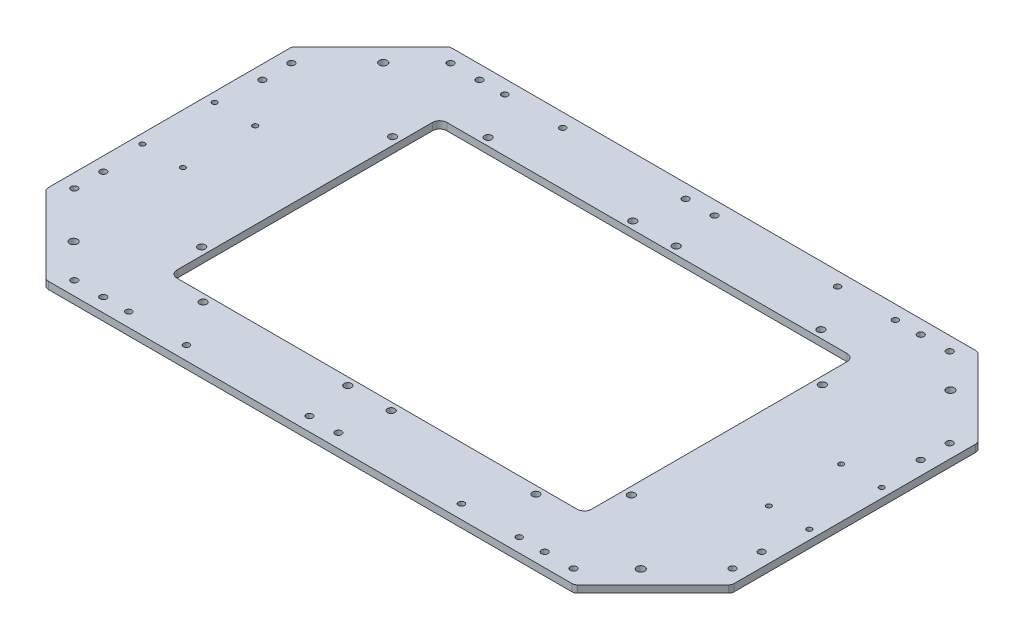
ISO-10303-21;
HEADER;
FILE_DESCRIPTION(('STEP AP214'),'2;1');
FILE_NAME('part.step','',(''),(''),'','','');
FILE_SCHEMA(('AUTOMOTIVE_DESIGN { 1 0 10303 214 1 1 1 1 }'));
ENDSEC;
DATA;
#1=APPLICATION_CONTEXT('core data for automotive mechanical design processes');
#2=APPLICATION_PROTOCOL_DEFINITION('international standard','automotive_design',2000,#1);
#3=PRODUCT_CONTEXT('',#1,'mechanical');
#4=PRODUCT('Part','Part','',(#3));
#5=PRODUCT_RELATED_PRODUCT_CATEGORY('part','',(#4));
#6=PRODUCT_DEFINITION_FORMATION('','',#4);
#7=PRODUCT_DEFINITION_CONTEXT('part definition',#1,'design');
#8=PRODUCT_DEFINITION('design','',#6,#7);
#9=PRODUCT_DEFINITION_SHAPE('','',#8);
#10=(LENGTH_UNIT() NAMED_UNIT(*) SI_UNIT(.MILLI.,.METRE.));
#11=(NAMED_UNIT(*) PLANE_ANGLE_UNIT() SI_UNIT($,.RADIAN.));
#12=(NAMED_UNIT(*) SI_UNIT($,.STERADIAN.) SOLID_ANGLE_UNIT());
#13=UNCERTAINTY_MEASURE_WITH_UNIT(LENGTH_MEASURE(1.E-05),#10,'distance_accuracy_value','');
#14=(GEOMETRIC_REPRESENTATION_CONTEXT(3) GLOBAL_UNCERTAINTY_ASSIGNED_CONTEXT((#13)) GLOBAL_UNIT_ASSIGNED_CONTEXT((#10,
#11,#12)) REPRESENTATION_CONTEXT('',''));
#15=CARTESIAN_POINT('',(0.,0.,0.));
#16=DIRECTION('',(0.,0.,1.));
#17=DIRECTION('',(1.,0.,0.));
#18=AXIS2_PLACEMENT_3D('',#15,#16,#17);
#19=CARTESIAN_POINT('',(0.,10.,0.));
#20=DIRECTION('',(0.,1.,0.));
#21=DIRECTION('',(0.,0.,1.));
#22=AXIS2_PLACEMENT_3D('',#19,#20,#21);
#23=PLANE('',#22);
#24=CARTESIAN_POINT('',(-270.,10.,-260.));
#25=DIRECTION('',(0.,1.,0.));
#26=DIRECTION('',(0.,0.,1.));
#27=AXIS2_PLACEMENT_3D('',#24,#25,#26);
#28=CIRCLE('',#27,4.19999999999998);
#29=CARTESIAN_POINT('',(-270.,10.,-255.8));
#30=VERTEX_POINT('',#29);
#31=EDGE_CURVE('E1277',#30,#30,#28,.T.);
#32=ORIENTED_EDGE('',*,*,#31,.F.);
#33=EDGE_LOOP('',(#32));
#34=FACE_BOUND('',#33,.T.);
#35=CARTESIAN_POINT('',(-190.,10.,-260.));
#36=DIRECTION('',(0.,1.,0.));
#37=DIRECTION('',(0.,0.,1.));
#38=AXIS2_PLACEMENT_3D('',#35,#36,#37);
#39=CIRCLE('',#38,4.20000000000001);
#40=CARTESIAN_POINT('',(-190.,10.,-255.8));
#41=VERTEX_POINT('',#40);
#42=EDGE_CURVE('E1279',#41,#41,#39,.T.);
#43=ORIENTED_EDGE('',*,*,#42,.F.);
#44=EDGE_LOOP('',(#43));
#45=FACE_BOUND('',#44,.T.);
#46=CARTESIAN_POINT('',(190.,10.,-260.));
#47=DIRECTION('',(0.,1.,0.));
#48=DIRECTION('',(0.,0.,1.));
#49=AXIS2_PLACEMENT_3D('',#46,#47,#48);
#50=CIRCLE('',#49,4.20000000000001);
#51=CARTESIAN_POINT('',(190.,10.,-255.8));
#52=VERTEX_POINT('',#51);
#53=EDGE_CURVE('E1287',#52,#52,#50,.T.);
#54=ORIENTED_EDGE('',*,*,#53,.F.);
#55=EDGE_LOOP('',(#54));
#56=FACE_BOUND('',#55,.T.);
#57=CARTESIAN_POINT('',(270.,10.,-260.));
#58=DIRECTION('',(0.,1.,0.));
#59=DIRECTION('',(0.,0.,1.));
#60=AXIS2_PLACEMENT_3D('',#57,#58,#59);
#61=CIRCLE('',#60,4.19999999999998);
#62=CARTESIAN_POINT('',(270.,10.,-255.8));
#63=VERTEX_POINT('',#62);
#64=EDGE_CURVE('E1293',#63,#63,#61,.T.);
#65=ORIENTED_EDGE('',*,*,#64,.F.);
#66=EDGE_LOOP('',(#65));
#67=FACE_BOUND('',#66,.T.);
#68=CARTESIAN_POINT('',(-270.,10.,260.));
#69=DIRECTION('',(0.,1.,0.));
#70=DIRECTION('',(0.,0.,1.));
#71=AXIS2_PLACEMENT_3D('',#68,#69,#70);
#72=CIRCLE('',#71,4.19999999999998);
#73=CARTESIAN_POINT('',(-270.,10.,264.2));
#74=VERTEX_POINT('',#73);
#75=EDGE_CURVE('E1299',#74,#74,#72,.T.);
#76=ORIENTED_EDGE('',*,*,#75,.F.);
#77=EDGE_LOOP('',(#76));
#78=FACE_BOUND('',#77,.T.);
#79=CARTESIAN_POINT('',(-190.,10.,260.));
#80=DIRECTION('',(0.,1.,0.));
#81=DIRECTION('',(0.,0.,1.));
#82=AXIS2_PLACEMENT_3D('',#79,#80,#81);
#83=CIRCLE('',#82,4.20000000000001);
#84=CARTESIAN_POINT('',(-190.,10.,264.2));
#85=VERTEX_POINT('',#84);
#86=EDGE_CURVE('E1305',#85,#85,#83,.T.);
#87=ORIENTED_EDGE('',*,*,#86,.F.);
#88=EDGE_LOOP('',(#87));
#89=FACE_BOUND('',#88,.T.);
#90=CARTESIAN_POINT('',(190.,10.,260.));
#91=DIRECTION('',(0.,1.,0.));
#92=DIRECTION('',(0.,0.,1.));
#93=AXIS2_PLACEMENT_3D('',#90,#91,#92);
#94=CIRCLE('',#93,4.20000000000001);
#95=CARTESIAN_POINT('',(190.,10.,264.2));
#96=VERTEX_POINT('',#95);
#97=EDGE_CURVE('E1311',#96,#96,#94,.T.);
#98=ORIENTED_EDGE('',*,*,#97,.F.);
#99=EDGE_LOOP('',(#98));
#100=FACE_BOUND('',#99,.T.);
#101=CARTESIAN_POINT('',(270.,10.,260.));
#102=DIRECTION('',(0.,1.,0.));
#103=DIRECTION('',(0.,0.,1.));
#104=AXIS2_PLACEMENT_3D('',#101,#102,#103);
#105=CIRCLE('',#104,4.19999999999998);
#106=CARTESIAN_POINT('',(270.,10.,264.2));
#107=VERTEX_POINT('',#106);
#108=EDGE_CURVE('E1317',#107,#107,#105,.T.);
#109=ORIENTED_EDGE('',*,*,#108,.F.);
#110=EDGE_LOOP('',(#109));
#111=FACE_BOUND('',#110,.T.);
#112=CARTESIAN_POINT('',(-297.,10.,-132.));
#113=DIRECTION('',(0.,1.,0.));
#114=DIRECTION('',(0.,0.,1.));
#115=AXIS2_PLACEMENT_3D('',#112,#113,#114);
#116=CIRCLE('',#115,5.);
#117=CARTESIAN_POINT('',(-297.,10.,-127.));
#118=VERTEX_POINT('',#117);
#119=EDGE_CURVE('E1323',#118,#118,#116,.T.);
#120=ORIENTED_EDGE('',*,*,#119,.F.);
#121=EDGE_LOOP('',(#120));
#122=FACE_BOUND('',#121,.T.);
#123=CARTESIAN_POINT('',(-230.,10.,-197.));
#124=DIRECTION('',(0.,1.,0.));
#125=DIRECTION('',(0.,0.,1.));
#126=AXIS2_PLACEMENT_3D('',#123,#124,#125);
#127=CIRCLE('',#126,5.);
#128=CARTESIAN_POINT('',(-230.,10.,-192.));
#129=VERTEX_POINT('',#128);
#130=EDGE_CURVE('E1329',#129,#129,#127,.T.);
#131=ORIENTED_EDGE('',*,*,#130,.F.);
#132=EDGE_LOOP('',(#131));
#133=FACE_BOUND('',#132,.T.);
#134=CARTESIAN_POINT('',(-30.,10.,-197.));
#135=DIRECTION('',(0.,1.,0.));
#136=DIRECTION('',(0.,0.,1.));
#137=AXIS2_PLACEMENT_3D('',#134,#135,#136);
#138=CIRCLE('',#137,5.);
#139=CARTESIAN_POINT('',(-30.,10.,-192.));
#140=VERTEX_POINT('',#139);
#141=EDGE_CURVE('E1335',#140,#140,#138,.T.);
#142=ORIENTED_EDGE('',*,*,#141,.F.);
#143=EDGE_LOOP('',(#142));
#144=FACE_BOUND('',#143,.T.);
#145=CARTESIAN_POINT('',(30.,10.,-197.));
#146=DIRECTION('',(0.,1.,0.));
#147=DIRECTION('',(0.,0.,1.));
#148=AXIS2_PLACEMENT_3D('',#145,#146,#147);
#149=CIRCLE('',#148,5.);
#150=CARTESIAN_POINT('',(30.,10.,-192.));
#151=VERTEX_POINT('',#150);
#152=EDGE_CURVE('E1341',#151,#151,#149,.T.);
#153=ORIENTED_EDGE('',*,*,#152,.F.);
#154=EDGE_LOOP('',(#153));
#155=FACE_BOUND('',#154,.T.);
#156=CARTESIAN_POINT('',(230.,10.,-197.));
#157=DIRECTION('',(0.,1.,0.));
#158=DIRECTION('',(0.,0.,1.));
#159=AXIS2_PLACEMENT_3D('',#156,#157,#158);
#160=CIRCLE('',#159,5.);
#161=CARTESIAN_POINT('',(230.,10.,-192.));
#162=VERTEX_POINT('',#161);
#163=EDGE_CURVE('E1347',#162,#162,#160,.T.);
#164=ORIENTED_EDGE('',*,*,#163,.F.);
#165=EDGE_LOOP('',(#164));
#166=FACE_BOUND('',#165,.T.);
#167=CARTESIAN_POINT('',(297.,10.,-132.));
#168=DIRECTION('',(0.,1.,0.));
#169=DIRECTION('',(0.,0.,1.));
#170=AXIS2_PLACEMENT_3D('',#167,#168,#169);
#171=CIRCLE('',#170,5.);
#172=CARTESIAN_POINT('',(297.,10.,-127.));
#173=VERTEX_POINT('',#172);
#174=EDGE_CURVE('E1353',#173,#173,#171,.T.);
#175=ORIENTED_EDGE('',*,*,#174,.F.);
#176=EDGE_LOOP('',(#175));
#177=FACE_BOUND('',#176,.T.);
#178=CARTESIAN_POINT('',(297.,10.,132.));
#179=DIRECTION('',(0.,1.,0.));
#180=DIRECTION('',(0.,0.,1.));
#181=AXIS2_PLACEMENT_3D('',#178,#179,#180);
#182=CIRCLE('',#181,5.);
#183=CARTESIAN_POINT('',(297.,10.,137.));
#184=VERTEX_POINT('',#183);
#185=EDGE_CURVE('E1359',#184,#184,#182,.T.);
#186=ORIENTED_EDGE('',*,*,#185,.F.);
#187=EDGE_LOOP('',(#186));
#188=FACE_BOUND('',#187,.T.);
#189=CARTESIAN_POINT('',(230.,10.,197.));
#190=DIRECTION('',(0.,1.,0.));
#191=DIRECTION('',(0.,0.,1.));
#192=AXIS2_PLACEMENT_3D('',#189,#190,#191);
#193=CIRCLE('',#192,5.);
#194=CARTESIAN_POINT('',(230.,10.,202.));
#195=VERTEX_POINT('',#194);
#196=EDGE_CURVE('E1365',#195,#195,#193,.T.);
#197=ORIENTED_EDGE('',*,*,#196,.F.);
#198=EDGE_LOOP('',(#197));
#199=FACE_BOUND('',#198,.T.);
#200=CARTESIAN_POINT('',(30.,10.,197.));
#201=DIRECTION('',(0.,1.,0.));
#202=DIRECTION('',(0.,0.,1.));
#203=AXIS2_PLACEMENT_3D('',#200,#201,#202);
#204=CIRCLE('',#203,4.99999999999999);
#205=CARTESIAN_POINT('',(30.,10.,202.));
#206=VERTEX_POINT('',#205);
#207=EDGE_CURVE('E1371',#206,#206,#204,.T.);
#208=ORIENTED_EDGE('',*,*,#207,.F.);
#209=EDGE_LOOP('',(#208));
#210=FACE_BOUND('',#209,.T.);
#211=CARTESIAN_POINT('',(-30.,10.,197.));
#212=DIRECTION('',(0.,1.,0.));
#213=DIRECTION('',(0.,0.,1.));
#214=AXIS2_PLACEMENT_3D('',#211,#212,#213);
#215=CIRCLE('',#214,5.);
#216=CARTESIAN_POINT('',(-30.,10.,202.));
#217=VERTEX_POINT('',#216);
#218=EDGE_CURVE('E1377',#217,#217,#215,.T.);
#219=ORIENTED_EDGE('',*,*,#218,.F.);
#220=EDGE_LOOP('',(#219));
#221=FACE_BOUND('',#220,.T.);
#222=CARTESIAN_POINT('',(-230.,10.,197.));
#223=DIRECTION('',(0.,1.,0.));
#224=DIRECTION('',(0.,0.,1.));
#225=AXIS2_PLACEMENT_3D('',#222,#223,#224);
#226=CIRCLE('',#225,5.);
#227=CARTESIAN_POINT('',(-230.,10.,202.));
#228=VERTEX_POINT('',#227);
#229=EDGE_CURVE('E1383',#228,#228,#226,.T.);
#230=ORIENTED_EDGE('',*,*,#229,.F.);
#231=EDGE_LOOP('',(#230));
#232=FACE_BOUND('',#231,.T.);
#233=CARTESIAN_POINT('',(-297.,10.,132.));
#234=DIRECTION('',(0.,1.,0.));
#235=DIRECTION('',(0.,0.,1.));
#236=AXIS2_PLACEMENT_3D('',#233,#234,#235);
#237=CIRCLE('',#236,5.);
#238=CARTESIAN_POINT('',(-297.,10.,137.));
#239=VERTEX_POINT('',#238);
#240=EDGE_CURVE('E1388',#239,#239,#237,.T.);
#241=ORIENTED_EDGE('',*,*,#240,.F.);
#242=EDGE_LOOP('',(#241));
#243=FACE_BOUND('',#242,.T.);
#244=CARTESIAN_POINT('',(-276.5,10.,-176.5));
#245=DIRECTION('',(0.,1.,0.));
#246=DIRECTION('',(0.,0.,1.));
#247=AXIS2_PLACEMENT_3D('',#244,#245,#246);
#248=CIRCLE('',#247,10.);
#249=CARTESIAN_POINT('',(-276.5,10.,-186.5));
#250=VERTEX_POINT('',#249);
#251=CARTESIAN_POINT('',(-286.5,10.,-176.5));
#252=VERTEX_POINT('',#251);
#253=EDGE_CURVE('E51',#250,#252,#248,.T.);
#254=ORIENTED_EDGE('',*,*,#253,.F.);
#255=DIRECTION('',(-1.,0.,0.));
#256=VECTOR('',#255,1.);
#257=CARTESIAN_POINT('',(-276.5,10.,-186.5));
#258=LINE('',#257,#256);
#259=CARTESIAN_POINT('',(276.5,10.,-186.5));
#260=VERTEX_POINT('',#259);
#261=EDGE_CURVE('E215',#260,#250,#258,.T.);
#262=ORIENTED_EDGE('',*,*,#261,.F.);
#263=CARTESIAN_POINT('',(276.5,10.,-176.5));
#264=DIRECTION('',(0.,1.,0.));
#265=DIRECTION('',(0.,0.,1.));
#266=AXIS2_PLACEMENT_3D('',#263,#264,#265);
#267=CIRCLE('',#266,10.);
#268=CARTESIAN_POINT('',(286.5,10.,-176.5));
#269=VERTEX_POINT('',#268);
#270=EDGE_CURVE('E218',#269,#260,#267,.T.);
#271=ORIENTED_EDGE('',*,*,#270,.F.);
#272=DIRECTION('',(0.,0.,-1.));
#273=VECTOR('',#272,1.);
#274=CARTESIAN_POINT('',(286.5,10.,176.5));
#275=LINE('',#274,#273);
#276=CARTESIAN_POINT('',(286.5,10.,176.5));
#277=VERTEX_POINT('',#276);
#278=EDGE_CURVE('E249',#277,#269,#275,.T.);
#279=ORIENTED_EDGE('',*,*,#278,.F.);
#280=CARTESIAN_POINT('',(276.5,10.,176.5));
#281=DIRECTION('',(0.,1.,0.));
#282=DIRECTION('',(0.,0.,-1.));
#283=AXIS2_PLACEMENT_3D('',#280,#281,#282);
#284=CIRCLE('',#283,10.);
#285=CARTESIAN_POINT('',(276.5,10.,186.5));
#286=VERTEX_POINT('',#285);
#287=EDGE_CURVE('E246',#286,#277,#284,.T.);
#288=ORIENTED_EDGE('',*,*,#287,.F.);
#289=DIRECTION('',(1.,0.,0.));
#290=VECTOR('',#289,1.);
#291=CARTESIAN_POINT('',(-276.5,10.,186.5));
#292=LINE('',#291,#290);
#293=CARTESIAN_POINT('',(-276.5,10.,186.5));
#294=VERTEX_POINT('',#293);
#295=EDGE_CURVE('E243',#294,#286,#292,.T.);
#296=ORIENTED_EDGE('',*,*,#295,.F.);
#297=CARTESIAN_POINT('',(-276.5,10.,176.5));
#298=DIRECTION('',(0.,1.,0.));
#299=DIRECTION('',(0.,0.,-1.));
#300=AXIS2_PLACEMENT_3D('',#297,#298,#299);
#301=CIRCLE('',#300,10.);
#302=CARTESIAN_POINT('',(-286.5,10.,176.5));
#303=VERTEX_POINT('',#302);
#304=EDGE_CURVE('E240',#303,#294,#301,.T.);
#305=ORIENTED_EDGE('',*,*,#304,.F.);
#306=DIRECTION('',(0.,0.,1.));
#307=VECTOR('',#306,1.);
#308=CARTESIAN_POINT('',(-286.5,10.,176.5));
#309=LINE('',#308,#307);
#310=EDGE_CURVE('E238',#252,#303,#309,.T.);
#311=ORIENTED_EDGE('',*,*,#310,.F.);
#312=EDGE_LOOP('',(#254,#262,#271,#279,#288,#296,#305,#311));
#313=FACE_BOUND('',#312,.T.);
#314=CARTESIAN_POINT('',(-461.,10.,-50.));
#315=DIRECTION('',(0.,1.,0.));
#316=DIRECTION('',(0.,0.,1.));
#317=AXIS2_PLACEMENT_3D('',#314,#315,#316);
#318=CIRCLE('',#317,3.5);
#319=CARTESIAN_POINT('',(-461.,10.,-46.5));
#320=VERTEX_POINT('',#319);
#321=EDGE_CURVE('E256',#320,#320,#318,.T.);
#322=ORIENTED_EDGE('',*,*,#321,.F.);
#323=EDGE_LOOP('',(#322));
#324=FACE_BOUND('',#323,.T.);
#325=CARTESIAN_POINT('',(-405.,10.,-50.));
#326=DIRECTION('',(0.,1.,0.));
#327=DIRECTION('',(0.,0.,1.));
#328=AXIS2_PLACEMENT_3D('',#325,#326,#327);
#329=CIRCLE('',#328,3.5);
#330=CARTESIAN_POINT('',(-405.,10.,-46.5));
#331=VERTEX_POINT('',#330);
#332=EDGE_CURVE('E270',#331,#331,#329,.T.);
#333=ORIENTED_EDGE('',*,*,#332,.F.);
#334=EDGE_LOOP('',(#333));
#335=FACE_BOUND('',#334,.T.);
#336=CARTESIAN_POINT('',(-405.,10.,50.));
#337=DIRECTION('',(0.,1.,0.));
#338=DIRECTION('',(0.,0.,1.));
#339=AXIS2_PLACEMENT_3D('',#336,#337,#338);
#340=CIRCLE('',#339,3.5);
#341=CARTESIAN_POINT('',(-405.,10.,53.5));
#342=VERTEX_POINT('',#341);
#343=EDGE_CURVE('E274',#342,#342,#340,.T.);
#344=ORIENTED_EDGE('',*,*,#343,.F.);
#345=EDGE_LOOP('',(#344));
#346=FACE_BOUND('',#345,.T.);
#347=CARTESIAN_POINT('',(-461.,10.,50.));
#348=DIRECTION('',(0.,1.,0.));
#349=DIRECTION('',(0.,0.,1.));
#350=AXIS2_PLACEMENT_3D('',#347,#348,#349);
#351=CIRCLE('',#350,3.5);
#352=CARTESIAN_POINT('',(-461.,10.,53.5));
#353=VERTEX_POINT('',#352);
#354=EDGE_CURVE('E278',#353,#353,#351,.T.);
#355=ORIENTED_EDGE('',*,*,#354,.F.);
#356=EDGE_LOOP('',(#355));
#357=FACE_BOUND('',#356,.T.);
#358=CARTESIAN_POINT('',(461.,10.,50.));
#359=DIRECTION('',(0.,1.,0.));
#360=DIRECTION('',(0.,0.,1.));
#361=AXIS2_PLACEMENT_3D('',#358,#359,#360);
#362=CIRCLE('',#361,3.5);
#363=CARTESIAN_POINT('',(461.,10.,53.5));
#364=VERTEX_POINT('',#363);
#365=EDGE_CURVE('E282',#364,#364,#362,.T.);
#366=ORIENTED_EDGE('',*,*,#365,.F.);
#367=EDGE_LOOP('',(#366));
#368=FACE_BOUND('',#367,.T.);
#369=CARTESIAN_POINT('',(405.,10.,50.));
#370=DIRECTION('',(0.,1.,0.));
#371=DIRECTION('',(0.,0.,1.));
#372=AXIS2_PLACEMENT_3D('',#369,#370,#371);
#373=CIRCLE('',#372,3.5);
#374=CARTESIAN_POINT('',(405.,10.,53.5));
#375=VERTEX_POINT('',#374);
#376=EDGE_CURVE('E286',#375,#375,#373,.T.);
#377=ORIENTED_EDGE('',*,*,#376,.F.);
#378=EDGE_LOOP('',(#377));
#379=FACE_BOUND('',#378,.T.);
#380=CARTESIAN_POINT('',(405.,10.,-50.));
#381=DIRECTION('',(0.,1.,0.));
#382=DIRECTION('',(0.,0.,1.));
#383=AXIS2_PLACEMENT_3D('',#380,#381,#382);
#384=CIRCLE('',#383,3.5);
#385=CARTESIAN_POINT('',(405.,10.,-46.5));
#386=VERTEX_POINT('',#385);
#387=EDGE_CURVE('E290',#386,#386,#384,.T.);
#388=ORIENTED_EDGE('',*,*,#387,.F.);
#389=EDGE_LOOP('',(#388));
#390=FACE_BOUND('',#389,.T.);
#391=CARTESIAN_POINT('',(461.,10.,-50.));
#392=DIRECTION('',(0.,1.,0.));
#393=DIRECTION('',(0.,0.,1.));
#394=AXIS2_PLACEMENT_3D('',#391,#392,#393);
#395=CIRCLE('',#394,3.5);
#396=CARTESIAN_POINT('',(461.,10.,-46.5));
#397=VERTEX_POINT('',#396);
#398=EDGE_CURVE('E294',#397,#397,#395,.T.);
#399=ORIENTED_EDGE('',*,*,#398,.F.);
#400=EDGE_LOOP('',(#399));
#401=FACE_BOUND('',#400,.T.);
#402=CARTESIAN_POINT('',(-392.,10.,-214.));
#403=DIRECTION('',(0.,1.,0.));
#404=DIRECTION('',(0.,0.,1.));
#405=AXIS2_PLACEMENT_3D('',#402,#403,#404);
#406=CIRCLE('',#405,5.50000000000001);
#407=CARTESIAN_POINT('',(-392.,10.,-208.5));
#408=VERTEX_POINT('',#407);
#409=EDGE_CURVE('E300',#408,#408,#406,.T.);
#410=ORIENTED_EDGE('',*,*,#409,.F.);
#411=EDGE_LOOP('',(#410));
#412=FACE_BOUND('',#411,.T.);
#413=CARTESIAN_POINT('',(392.,10.,214.));
#414=DIRECTION('',(0.,1.,0.));
#415=DIRECTION('',(0.,0.,1.));
#416=AXIS2_PLACEMENT_3D('',#413,#414,#415);
#417=CIRCLE('',#416,5.50000000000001);
#418=CARTESIAN_POINT('',(392.,10.,219.5));
#419=VERTEX_POINT('',#418);
#420=EDGE_CURVE('E306',#419,#419,#417,.T.);
#421=ORIENTED_EDGE('',*,*,#420,.F.);
#422=EDGE_LOOP('',(#421));
#423=FACE_BOUND('',#422,.T.);
#424=CARTESIAN_POINT('',(392.,10.,-214.));
#425=DIRECTION('',(0.,1.,0.));
#426=DIRECTION('',(0.,0.,1.));
#427=AXIS2_PLACEMENT_3D('',#424,#425,#426);
#428=CIRCLE('',#427,5.50000000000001);
#429=CARTESIAN_POINT('',(392.,10.,-208.5));
#430=VERTEX_POINT('',#429);
#431=EDGE_CURVE('E312',#430,#430,#428,.T.);
#432=ORIENTED_EDGE('',*,*,#431,.F.);
#433=EDGE_LOOP('',(#432));
#434=FACE_BOUND('',#433,.T.);
#435=CARTESIAN_POINT('',(-392.,10.,214.));
#436=DIRECTION('',(0.,1.,0.));
#437=DIRECTION('',(0.,0.,1.));
#438=AXIS2_PLACEMENT_3D('',#435,#436,#437);
#439=CIRCLE('',#438,5.50000000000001);
#440=CARTESIAN_POINT('',(-392.,10.,219.5));
#441=VERTEX_POINT('',#440);
#442=EDGE_CURVE('E318',#441,#441,#439,.T.);
#443=ORIENTED_EDGE('',*,*,#442,.F.);
#444=EDGE_LOOP('',(#443));
#445=FACE_BOUND('',#444,.T.);
#446=CARTESIAN_POINT('',(20.,10.,260.));
#447=DIRECTION('',(0.,1.,0.));
#448=DIRECTION('',(0.,0.,1.));
#449=AXIS2_PLACEMENT_3D('',#446,#447,#448);
#450=CIRCLE('',#449,4.5);
#451=CARTESIAN_POINT('',(20.,10.,264.5));
#452=VERTEX_POINT('',#451);
#453=EDGE_CURVE('E43',#452,#452,#450,.T.);
#454=ORIENTED_EDGE('',*,*,#453,.F.);
#455=EDGE_LOOP('',(#454));
#456=FACE_BOUND('',#455,.T.);
#457=CARTESIAN_POINT('',(-20.,10.,260.));
#458=DIRECTION('',(0.,1.,0.));
#459=DIRECTION('',(0.,0.,1.));
#460=AXIS2_PLACEMENT_3D('',#457,#458,#459);
#461=CIRCLE('',#460,4.5);
#462=CARTESIAN_POINT('',(-20.,10.,264.5));
#463=VERTEX_POINT('',#462);
#464=EDGE_CURVE('E560',#463,#463,#461,.T.);
#465=ORIENTED_EDGE('',*,*,#464,.F.);
#466=EDGE_LOOP('',(#465));
#467=FACE_BOUND('',#466,.T.);
#468=CARTESIAN_POINT('',(20.,10.,-260.));
#469=DIRECTION('',(0.,1.,0.));
#470=DIRECTION('',(0.,0.,1.));
#471=AXIS2_PLACEMENT_3D('',#468,#469,#470);
#472=CIRCLE('',#471,4.5);
#473=CARTESIAN_POINT('',(20.,10.,-255.5));
#474=VERTEX_POINT('',#473);
#475=EDGE_CURVE('E554',#474,#474,#472,.T.);
#476=ORIENTED_EDGE('',*,*,#475,.F.);
#477=EDGE_LOOP('',(#476));
#478=FACE_BOUND('',#477,.T.);
#479=CARTESIAN_POINT('',(-20.,10.,-260.));
#480=DIRECTION('',(0.,1.,0.));
#481=DIRECTION('',(0.,0.,1.));
#482=AXIS2_PLACEMENT_3D('',#479,#480,#481);
#483=CIRCLE('',#482,4.5);
#484=CARTESIAN_POINT('',(-20.,10.,-255.5));
#485=VERTEX_POINT('',#484);
#486=EDGE_CURVE('E548',#485,#485,#483,.T.);
#487=ORIENTED_EDGE('',*,*,#486,.F.);
#488=EDGE_LOOP('',(#487));
#489=FACE_BOUND('',#488,.T.);
#490=CARTESIAN_POINT('',(455.,10.,150.));
#491=DIRECTION('',(0.,1.,0.));
#492=DIRECTION('',(0.,0.,1.));
#493=AXIS2_PLACEMENT_3D('',#490,#491,#492);
#494=CIRCLE('',#493,4.5);
#495=CARTESIAN_POINT('',(455.,10.,154.5));
#496=VERTEX_POINT('',#495);
#497=EDGE_CURVE('E542',#496,#496,#494,.T.);
#498=ORIENTED_EDGE('',*,*,#497,.F.);
#499=EDGE_LOOP('',(#498));
#500=FACE_BOUND('',#499,.T.);
#501=CARTESIAN_POINT('',(455.,10.,110.));
#502=DIRECTION('',(0.,1.,0.));
#503=DIRECTION('',(0.,0.,1.));
#504=AXIS2_PLACEMENT_3D('',#501,#502,#503);
#505=CIRCLE('',#504,4.5);
#506=CARTESIAN_POINT('',(455.,10.,114.5));
#507=VERTEX_POINT('',#506);
#508=EDGE_CURVE('E536',#507,#507,#505,.T.);
#509=ORIENTED_EDGE('',*,*,#508,.F.);
#510=EDGE_LOOP('',(#509));
#511=FACE_BOUND('',#510,.T.);
#512=CARTESIAN_POINT('',(455.,10.,-110.));
#513=DIRECTION('',(0.,1.,0.));
#514=DIRECTION('',(0.,0.,1.));
#515=AXIS2_PLACEMENT_3D('',#512,#513,#514);
#516=CIRCLE('',#515,4.5);
#517=CARTESIAN_POINT('',(455.,10.,-105.5));
#518=VERTEX_POINT('',#517);
#519=EDGE_CURVE('E530',#518,#518,#516,.T.);
#520=ORIENTED_EDGE('',*,*,#519,.F.);
#521=EDGE_LOOP('',(#520));
#522=FACE_BOUND('',#521,.T.);
#523=CARTESIAN_POINT('',(455.,10.,-150.));
#524=DIRECTION('',(0.,1.,0.));
#525=DIRECTION('',(0.,0.,1.));
#526=AXIS2_PLACEMENT_3D('',#523,#524,#525);
#527=CIRCLE('',#526,4.5);
#528=CARTESIAN_POINT('',(455.,10.,-145.5));
#529=VERTEX_POINT('',#528);
#530=EDGE_CURVE('E524',#529,#529,#527,.T.);
#531=ORIENTED_EDGE('',*,*,#530,.F.);
#532=EDGE_LOOP('',(#531));
#533=FACE_BOUND('',#532,.T.);
#534=CARTESIAN_POINT('',(-455.,10.,150.));
#535=DIRECTION('',(0.,1.,0.));
#536=DIRECTION('',(0.,0.,1.));
#537=AXIS2_PLACEMENT_3D('',#534,#535,#536);
#538=CIRCLE('',#537,4.5);
#539=CARTESIAN_POINT('',(-455.,10.,154.5));
#540=VERTEX_POINT('',#539);
#541=EDGE_CURVE('E518',#540,#540,#538,.T.);
#542=ORIENTED_EDGE('',*,*,#541,.F.);
#543=EDGE_LOOP('',(#542));
#544=FACE_BOUND('',#543,.T.);
#545=CARTESIAN_POINT('',(-455.,10.,110.));
#546=DIRECTION('',(0.,1.,0.));
#547=DIRECTION('',(0.,0.,1.));
#548=AXIS2_PLACEMENT_3D('',#545,#546,#547);
#549=CIRCLE('',#548,4.5);
#550=CARTESIAN_POINT('',(-455.,10.,114.5));
#551=VERTEX_POINT('',#550);
#552=EDGE_CURVE('E512',#551,#551,#549,.T.);
#553=ORIENTED_EDGE('',*,*,#552,.F.);
#554=EDGE_LOOP('',(#553));
#555=FACE_BOUND('',#554,.T.);
#556=CARTESIAN_POINT('',(-455.,10.,-110.));
#557=DIRECTION('',(0.,1.,0.));
#558=DIRECTION('',(0.,0.,1.));
#559=AXIS2_PLACEMENT_3D('',#556,#557,#558);
#560=CIRCLE('',#559,4.5);
#561=CARTESIAN_POINT('',(-455.,10.,-105.5));
#562=VERTEX_POINT('',#561);
#563=EDGE_CURVE('E506',#562,#562,#560,.T.);
#564=ORIENTED_EDGE('',*,*,#563,.F.);
#565=EDGE_LOOP('',(#564));
#566=FACE_BOUND('',#565,.T.);
#567=CARTESIAN_POINT('',(-455.,10.,-150.));
#568=DIRECTION('',(0.,1.,0.));
#569=DIRECTION('',(0.,0.,1.));
#570=AXIS2_PLACEMENT_3D('',#567,#568,#569);
#571=CIRCLE('',#570,4.5);
#572=CARTESIAN_POINT('',(-455.,10.,-145.5));
#573=VERTEX_POINT('',#572);
#574=EDGE_CURVE('E500',#573,#573,#571,.T.);
#575=ORIENTED_EDGE('',*,*,#574,.F.);
#576=EDGE_LOOP('',(#575));
#577=FACE_BOUND('',#576,.T.);
#578=CARTESIAN_POINT('',(305.,10.,-260.));
#579=DIRECTION('',(0.,1.,0.));
#580=DIRECTION('',(0.,0.,1.));
#581=AXIS2_PLACEMENT_3D('',#578,#579,#580);
#582=CIRCLE('',#581,4.5);
#583=CARTESIAN_POINT('',(305.,10.,-255.5));
#584=VERTEX_POINT('',#583);
#585=EDGE_CURVE('E494',#584,#584,#582,.T.);
#586=ORIENTED_EDGE('',*,*,#585,.F.);
#587=EDGE_LOOP('',(#586));
#588=FACE_BOUND('',#587,.T.);
#589=CARTESIAN_POINT('',(305.,10.,260.));
#590=DIRECTION('',(0.,1.,0.));
#591=DIRECTION('',(0.,0.,1.));
#592=AXIS2_PLACEMENT_3D('',#589,#590,#591);
#593=CIRCLE('',#592,4.5);
#594=CARTESIAN_POINT('',(305.,10.,264.5));
#595=VERTEX_POINT('',#594);
#596=EDGE_CURVE('E488',#595,#595,#593,.T.);
#597=ORIENTED_EDGE('',*,*,#596,.F.);
#598=EDGE_LOOP('',(#597));
#599=FACE_BOUND('',#598,.T.);
#600=CARTESIAN_POINT('',(-305.,10.,260.));
#601=DIRECTION('',(0.,1.,0.));
#602=DIRECTION('',(0.,0.,1.));
#603=AXIS2_PLACEMENT_3D('',#600,#601,#602);
#604=CIRCLE('',#603,4.5);
#605=CARTESIAN_POINT('',(-305.,10.,264.5));
#606=VERTEX_POINT('',#605);
#607=EDGE_CURVE('E482',#606,#606,#604,.T.);
#608=ORIENTED_EDGE('',*,*,#607,.F.);
#609=EDGE_LOOP('',(#608));
#610=FACE_BOUND('',#609,.T.);
#611=CARTESIAN_POINT('',(-305.,10.,-260.));
#612=DIRECTION('',(0.,1.,0.));
#613=DIRECTION('',(0.,0.,1.));
#614=AXIS2_PLACEMENT_3D('',#611,#612,#613);
#615=CIRCLE('',#614,4.5);
#616=CARTESIAN_POINT('',(-305.,10.,-255.5));
#617=VERTEX_POINT('',#616);
#618=EDGE_CURVE('E476',#617,#617,#615,.T.);
#619=ORIENTED_EDGE('',*,*,#618,.F.);
#620=EDGE_LOOP('',(#619));
#621=FACE_BOUND('',#620,.T.);
#622=CARTESIAN_POINT('',(-345.,10.,260.));
#623=DIRECTION('',(0.,1.,0.));
#624=DIRECTION('',(0.,0.,1.));
#625=AXIS2_PLACEMENT_3D('',#622,#623,#624);
#626=CIRCLE('',#625,4.5);
#627=CARTESIAN_POINT('',(-345.,10.,264.5));
#628=VERTEX_POINT('',#627);
#629=EDGE_CURVE('E470',#628,#628,#626,.T.);
#630=ORIENTED_EDGE('',*,*,#629,.F.);
#631=EDGE_LOOP('',(#630));
#632=FACE_BOUND('',#631,.T.);
#633=CARTESIAN_POINT('',(345.,10.,-260.));
#634=DIRECTION('',(0.,1.,0.));
#635=DIRECTION('',(0.,0.,1.));
#636=AXIS2_PLACEMENT_3D('',#633,#634,#635);
#637=CIRCLE('',#636,4.5);
#638=CARTESIAN_POINT('',(345.,10.,-255.5));
#639=VERTEX_POINT('',#638);
#640=EDGE_CURVE('E464',#639,#639,#637,.T.);
#641=ORIENTED_EDGE('',*,*,#640,.F.);
#642=EDGE_LOOP('',(#641));
#643=FACE_BOUND('',#642,.T.);
#644=CARTESIAN_POINT('',(345.,10.,260.));
#645=DIRECTION('',(0.,1.,0.));
#646=DIRECTION('',(0.,0.,1.));
#647=AXIS2_PLACEMENT_3D('',#644,#645,#646);
#648=CIRCLE('',#647,4.5);
#649=CARTESIAN_POINT('',(345.,10.,264.5));
#650=VERTEX_POINT('',#649);
#651=EDGE_CURVE('E458',#650,#650,#648,.T.);
#652=ORIENTED_EDGE('',*,*,#651,.F.);
#653=EDGE_LOOP('',(#652));
#654=FACE_BOUND('',#653,.T.);
#655=CARTESIAN_POINT('',(-345.,10.,-260.));
#656=DIRECTION('',(0.,1.,0.));
#657=DIRECTION('',(0.,0.,1.));
#658=AXIS2_PLACEMENT_3D('',#655,#656,#657);
#659=CIRCLE('',#658,4.5);
#660=CARTESIAN_POINT('',(-345.,10.,-255.5));
#661=VERTEX_POINT('',#660);
#662=EDGE_CURVE('E422',#661,#661,#659,.T.);
#663=ORIENTED_EDGE('',*,*,#662,.F.);
#664=EDGE_LOOP('',(#663));
#665=FACE_BOUND('',#664,.T.);
#666=DIRECTION('',(-1.,0.,0.));
#667=VECTOR('',#666,1.);
#668=CARTESIAN_POINT('',(361.857864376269,10.,-279.));
#669=LINE('',#668,#667);
#670=CARTESIAN_POINT('',(361.857864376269,10.,-279.));
#671=VERTEX_POINT('',#670);
#672=CARTESIAN_POINT('',(-361.857864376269,10.,-279.));
#673=VERTEX_POINT('',#672);
#674=EDGE_CURVE('E328',#671,#673,#669,.T.);
#675=ORIENTED_EDGE('',*,*,#674,.T.);
#676=CARTESIAN_POINT('',(-361.857864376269,10.,-271.));
#677=DIRECTION('',(0.,1.,0.));
#678=DIRECTION('',(0.,0.,1.));
#679=AXIS2_PLACEMENT_3D('',#676,#677,#678);
#680=CIRCLE('',#679,8.00000000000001);
#681=CARTESIAN_POINT('',(-367.514718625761,10.,-276.656854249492));
#682=VERTEX_POINT('',#681);
#683=EDGE_CURVE('E324',#673,#682,#680,.T.);
#684=ORIENTED_EDGE('',*,*,#683,.T.);
#685=DIRECTION('',(-0.707106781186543,0.,0.707106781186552));
#686=VECTOR('',#685,1.);
#687=CARTESIAN_POINT('',(-367.514718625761,10.,-276.656854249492));
#688=LINE('',#687,#686);
#689=CARTESIAN_POINT('',(-471.656854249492,10.,-172.51471862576));
#690=VERTEX_POINT('',#689);
#691=EDGE_CURVE('E376',#682,#690,#688,.T.);
#692=ORIENTED_EDGE('',*,*,#691,.T.);
#693=CARTESIAN_POINT('',(-466.,10.,-166.857864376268));
#694=DIRECTION('',(0.,1.,0.));
#695=DIRECTION('',(0.,0.,1.));
#696=AXIS2_PLACEMENT_3D('',#693,#694,#695);
#697=CIRCLE('',#696,8.00000000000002);
#698=CARTESIAN_POINT('',(-474.,10.,-166.857864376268));
#699=VERTEX_POINT('',#698);
#700=EDGE_CURVE('E379',#690,#699,#697,.T.);
#701=ORIENTED_EDGE('',*,*,#700,.T.);
#702=DIRECTION('',(0.,0.,1.));
#703=VECTOR('',#702,1.);
#704=CARTESIAN_POINT('',(-474.,10.,-166.857864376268));
#705=LINE('',#704,#703);
#706=CARTESIAN_POINT('',(-474.,10.,166.857864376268));
#707=VERTEX_POINT('',#706);
#708=EDGE_CURVE('E382',#699,#707,#705,.T.);
#709=ORIENTED_EDGE('',*,*,#708,.T.);
#710=CARTESIAN_POINT('',(-466.,10.,166.857864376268));
#711=DIRECTION('',(0.,1.,0.));
#712=DIRECTION('',(0.,0.,1.));
#713=AXIS2_PLACEMENT_3D('',#710,#711,#712);
#714=CIRCLE('',#713,8.);
#715=CARTESIAN_POINT('',(-471.656854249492,10.,172.51471862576));
#716=VERTEX_POINT('',#715);
#717=EDGE_CURVE('E385',#707,#716,#714,.T.);
#718=ORIENTED_EDGE('',*,*,#717,.T.);
#719=DIRECTION('',(0.707106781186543,0.,0.707106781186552));
#720=VECTOR('',#719,1.);
#721=CARTESIAN_POINT('',(-471.656854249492,10.,172.51471862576));
#722=LINE('',#721,#720);
#723=CARTESIAN_POINT('',(-367.514718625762,10.,276.656854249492));
#724=VERTEX_POINT('',#723);
#725=EDGE_CURVE('E388',#716,#724,#722,.T.);
#726=ORIENTED_EDGE('',*,*,#725,.T.);
#727=CARTESIAN_POINT('',(-361.857864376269,10.,271.));
#728=DIRECTION('',(0.,1.,0.));
#729=DIRECTION('',(0.,0.,1.));
#730=AXIS2_PLACEMENT_3D('',#727,#728,#729);
#731=CIRCLE('',#730,8.00000000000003);
#732=CARTESIAN_POINT('',(-361.857864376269,10.,279.));
#733=VERTEX_POINT('',#732);
#734=EDGE_CURVE('E391',#724,#733,#731,.T.);
#735=ORIENTED_EDGE('',*,*,#734,.T.);
#736=DIRECTION('',(1.,0.,0.));
#737=VECTOR('',#736,1.);
#738=CARTESIAN_POINT('',(-361.857864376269,10.,279.));
#739=LINE('',#738,#737);
#740=CARTESIAN_POINT('',(361.857864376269,10.,279.));
#741=VERTEX_POINT('',#740);
#742=EDGE_CURVE('E394',#733,#741,#739,.T.);
#743=ORIENTED_EDGE('',*,*,#742,.T.);
#744=CARTESIAN_POINT('',(361.857864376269,10.,271.));
#745=DIRECTION('',(0.,1.,0.));
#746=DIRECTION('',(0.,0.,1.));
#747=AXIS2_PLACEMENT_3D('',#744,#745,#746);
#748=CIRCLE('',#747,8.00000000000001);
#749=CARTESIAN_POINT('',(367.514718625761,10.,276.656854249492));
#750=VERTEX_POINT('',#749);
#751=EDGE_CURVE('E397',#741,#750,#748,.T.);
#752=ORIENTED_EDGE('',*,*,#751,.T.);
#753=DIRECTION('',(0.707106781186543,0.,-0.707106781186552));
#754=VECTOR('',#753,1.);
#755=CARTESIAN_POINT('',(367.514718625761,10.,276.656854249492));
#756=LINE('',#755,#754);
#757=CARTESIAN_POINT('',(471.656854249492,10.,172.51471862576));
#758=VERTEX_POINT('',#757);
#759=EDGE_CURVE('E400',#750,#758,#756,.T.);
#760=ORIENTED_EDGE('',*,*,#759,.T.);
#761=CARTESIAN_POINT('',(466.,10.,166.857864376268));
#762=DIRECTION('',(0.,1.,0.));
#763=DIRECTION('',(0.,0.,1.));
#764=AXIS2_PLACEMENT_3D('',#761,#762,#763);
#765=CIRCLE('',#764,8.00000000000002);
#766=CARTESIAN_POINT('',(474.,10.,166.857864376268));
#767=VERTEX_POINT('',#766);
#768=EDGE_CURVE('E403',#758,#767,#765,.T.);
#769=ORIENTED_EDGE('',*,*,#768,.T.);
#770=DIRECTION('',(0.,0.,-1.));
#771=VECTOR('',#770,1.);
#772=CARTESIAN_POINT('',(474.,10.,166.857864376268));
#773=LINE('',#772,#771);
#774=CARTESIAN_POINT('',(474.,10.,-166.857864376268));
#775=VERTEX_POINT('',#774);
#776=EDGE_CURVE('E406',#767,#775,#773,.T.);
#777=ORIENTED_EDGE('',*,*,#776,.T.);
#778=CARTESIAN_POINT('',(466.,10.,-166.857864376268));
#779=DIRECTION('',(0.,1.,0.));
#780=DIRECTION('',(0.,0.,1.));
#781=AXIS2_PLACEMENT_3D('',#778,#779,#780);
#782=CIRCLE('',#781,8.);
#783=CARTESIAN_POINT('',(471.656854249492,10.,-172.51471862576));
#784=VERTEX_POINT('',#783);
#785=EDGE_CURVE('E409',#775,#784,#782,.T.);
#786=ORIENTED_EDGE('',*,*,#785,.T.);
#787=DIRECTION('',(-0.707106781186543,0.,-0.707106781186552));
#788=VECTOR('',#787,1.);
#789=CARTESIAN_POINT('',(471.656854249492,10.,-172.51471862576));
#790=LINE('',#789,#788);
#791=CARTESIAN_POINT('',(367.514718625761,10.,-276.656854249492));
#792=VERTEX_POINT('',#791);
#793=EDGE_CURVE('E412',#784,#792,#790,.T.);
#794=ORIENTED_EDGE('',*,*,#793,.T.);
#795=CARTESIAN_POINT('',(361.857864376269,10.,-271.));
#796=DIRECTION('',(0.,1.,0.));
#797=DIRECTION('',(0.,0.,1.));
#798=AXIS2_PLACEMENT_3D('',#795,#796,#797);
#799=CIRCLE('',#798,8.00000000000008);
#800=EDGE_CURVE('E415',#792,#671,#799,.T.);
#801=ORIENTED_EDGE('',*,*,#800,.T.);
#802=EDGE_LOOP('',(#675,#684,#692,#701,#709,#718,#726,#735,#743,#752,#760,#769,#777,#786,#794,#801));
#803=FACE_BOUND('',#802,.T.);
#804=ADVANCED_FACE('F34',(#34,#45,#56,#67,#78,#89,#100,#111,#122,#133,#144,#155,#166,#177,#188,
#199,#210,#221,#232,#243,#313,#324,#335,#346,#357,#368,#379,#390,#401,#412,#423,#434,#445,#456,
#467,#478,#489,#500,#511,#522,#533,#544,#555,#566,#577,#588,#599,#610,#621,#632,#643,#654,#665,
#803),#23,.T.);
#805=CARTESIAN_POINT('',(0.,0.,0.));
#806=DIRECTION('',(0.,1.,0.));
#807=DIRECTION('',(0.,0.,1.));
#808=AXIS2_PLACEMENT_3D('',#805,#806,#807);
#809=PLANE('',#808);
#810=CARTESIAN_POINT('',(-270.,0.,-260.));
#811=DIRECTION('',(0.,1.,0.));
#812=DIRECTION('',(0.,0.,1.));
#813=AXIS2_PLACEMENT_3D('',#810,#811,#812);
#814=CIRCLE('',#813,4.19999999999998);
#815=CARTESIAN_POINT('',(-270.,0.,-255.8));
#816=VERTEX_POINT('',#815);
#817=EDGE_CURVE('E1275',#816,#816,#814,.T.);
#818=ORIENTED_EDGE('',*,*,#817,.T.);
#819=EDGE_LOOP('',(#818));
#820=FACE_BOUND('',#819,.T.);
#821=CARTESIAN_POINT('',(-190.,0.,-260.));
#822=DIRECTION('',(0.,1.,0.));
#823=DIRECTION('',(0.,0.,1.));
#824=AXIS2_PLACEMENT_3D('',#821,#822,#823);
#825=CIRCLE('',#824,4.20000000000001);
#826=CARTESIAN_POINT('',(-190.,0.,-255.8));
#827=VERTEX_POINT('',#826);
#828=EDGE_CURVE('E1284',#827,#827,#825,.T.);
#829=ORIENTED_EDGE('',*,*,#828,.T.);
#830=EDGE_LOOP('',(#829));
#831=FACE_BOUND('',#830,.T.);
#832=CARTESIAN_POINT('',(190.,0.,-260.));
#833=DIRECTION('',(0.,1.,0.));
#834=DIRECTION('',(0.,0.,1.));
#835=AXIS2_PLACEMENT_3D('',#832,#833,#834);
#836=CIRCLE('',#835,4.20000000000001);
#837=CARTESIAN_POINT('',(190.,0.,-255.8));
#838=VERTEX_POINT('',#837);
#839=EDGE_CURVE('E1290',#838,#838,#836,.T.);
#840=ORIENTED_EDGE('',*,*,#839,.T.);
#841=EDGE_LOOP('',(#840));
#842=FACE_BOUND('',#841,.T.);
#843=CARTESIAN_POINT('',(270.,0.,-260.));
#844=DIRECTION('',(0.,1.,0.));
#845=DIRECTION('',(0.,0.,1.));
#846=AXIS2_PLACEMENT_3D('',#843,#844,#845);
#847=CIRCLE('',#846,4.19999999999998);
#848=CARTESIAN_POINT('',(270.,0.,-255.8));
#849=VERTEX_POINT('',#848);
#850=EDGE_CURVE('E1296',#849,#849,#847,.T.);
#851=ORIENTED_EDGE('',*,*,#850,.T.);
#852=EDGE_LOOP('',(#851));
#853=FACE_BOUND('',#852,.T.);
#854=CARTESIAN_POINT('',(-270.,0.,260.));
#855=DIRECTION('',(0.,1.,0.));
#856=DIRECTION('',(0.,0.,1.));
#857=AXIS2_PLACEMENT_3D('',#854,#855,#856);
#858=CIRCLE('',#857,4.19999999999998);
#859=CARTESIAN_POINT('',(-270.,0.,264.2));
#860=VERTEX_POINT('',#859);
#861=EDGE_CURVE('E1302',#860,#860,#858,.T.);
#862=ORIENTED_EDGE('',*,*,#861,.T.);
#863=EDGE_LOOP('',(#862));
#864=FACE_BOUND('',#863,.T.);
#865=CARTESIAN_POINT('',(-190.,0.,260.));
#866=DIRECTION('',(0.,1.,0.));
#867=DIRECTION('',(0.,0.,1.));
#868=AXIS2_PLACEMENT_3D('',#865,#866,#867);
#869=CIRCLE('',#868,4.20000000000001);
#870=CARTESIAN_POINT('',(-190.,0.,264.2));
#871=VERTEX_POINT('',#870);
#872=EDGE_CURVE('E1308',#871,#871,#869,.T.);
#873=ORIENTED_EDGE('',*,*,#872,.T.);
#874=EDGE_LOOP('',(#873));
#875=FACE_BOUND('',#874,.T.);
#876=CARTESIAN_POINT('',(190.,0.,260.));
#877=DIRECTION('',(0.,1.,0.));
#878=DIRECTION('',(0.,0.,1.));
#879=AXIS2_PLACEMENT_3D('',#876,#877,#878);
#880=CIRCLE('',#879,4.20000000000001);
#881=CARTESIAN_POINT('',(190.,0.,264.2));
#882=VERTEX_POINT('',#881);
#883=EDGE_CURVE('E1314',#882,#882,#880,.T.);
#884=ORIENTED_EDGE('',*,*,#883,.T.);
#885=EDGE_LOOP('',(#884));
#886=FACE_BOUND('',#885,.T.);
#887=CARTESIAN_POINT('',(270.,0.,260.));
#888=DIRECTION('',(0.,1.,0.));
#889=DIRECTION('',(0.,0.,1.));
#890=AXIS2_PLACEMENT_3D('',#887,#888,#889);
#891=CIRCLE('',#890,4.19999999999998);
#892=CARTESIAN_POINT('',(270.,0.,264.2));
#893=VERTEX_POINT('',#892);
#894=EDGE_CURVE('E1320',#893,#893,#891,.T.);
#895=ORIENTED_EDGE('',*,*,#894,.T.);
#896=EDGE_LOOP('',(#895));
#897=FACE_BOUND('',#896,.T.);
#898=CARTESIAN_POINT('',(-297.,0.,-132.));
#899=DIRECTION('',(0.,1.,0.));
#900=DIRECTION('',(0.,0.,1.));
#901=AXIS2_PLACEMENT_3D('',#898,#899,#900);
#902=CIRCLE('',#901,5.);
#903=CARTESIAN_POINT('',(-297.,0.,-127.));
#904=VERTEX_POINT('',#903);
#905=EDGE_CURVE('E1326',#904,#904,#902,.T.);
#906=ORIENTED_EDGE('',*,*,#905,.T.);
#907=EDGE_LOOP('',(#906));
#908=FACE_BOUND('',#907,.T.);
#909=CARTESIAN_POINT('',(-230.,0.,-197.));
#910=DIRECTION('',(0.,1.,0.));
#911=DIRECTION('',(0.,0.,1.));
#912=AXIS2_PLACEMENT_3D('',#909,#910,#911);
#913=CIRCLE('',#912,5.);
#914=CARTESIAN_POINT('',(-230.,0.,-192.));
#915=VERTEX_POINT('',#914);
#916=EDGE_CURVE('E1332',#915,#915,#913,.T.);
#917=ORIENTED_EDGE('',*,*,#916,.T.);
#918=EDGE_LOOP('',(#917));
#919=FACE_BOUND('',#918,.T.);
#920=CARTESIAN_POINT('',(-30.,0.,-197.));
#921=DIRECTION('',(0.,1.,0.));
#922=DIRECTION('',(0.,0.,1.));
#923=AXIS2_PLACEMENT_3D('',#920,#921,#922);
#924=CIRCLE('',#923,5.);
#925=CARTESIAN_POINT('',(-30.,0.,-192.));
#926=VERTEX_POINT('',#925);
#927=EDGE_CURVE('E1338',#926,#926,#924,.T.);
#928=ORIENTED_EDGE('',*,*,#927,.T.);
#929=EDGE_LOOP('',(#928));
#930=FACE_BOUND('',#929,.T.);
#931=CARTESIAN_POINT('',(30.,0.,-197.));
#932=DIRECTION('',(0.,1.,0.));
#933=DIRECTION('',(0.,0.,1.));
#934=AXIS2_PLACEMENT_3D('',#931,#932,#933);
#935=CIRCLE('',#934,4.99999999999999);
#936=CARTESIAN_POINT('',(30.,0.,-192.));
#937=VERTEX_POINT('',#936);
#938=EDGE_CURVE('E1344',#937,#937,#935,.T.);
#939=ORIENTED_EDGE('',*,*,#938,.T.);
#940=EDGE_LOOP('',(#939));
#941=FACE_BOUND('',#940,.T.);
#942=CARTESIAN_POINT('',(230.,0.,-197.));
#943=DIRECTION('',(0.,1.,0.));
#944=DIRECTION('',(0.,0.,1.));
#945=AXIS2_PLACEMENT_3D('',#942,#943,#944);
#946=CIRCLE('',#945,5.);
#947=CARTESIAN_POINT('',(230.,0.,-192.));
#948=VERTEX_POINT('',#947);
#949=EDGE_CURVE('E1350',#948,#948,#946,.T.);
#950=ORIENTED_EDGE('',*,*,#949,.T.);
#951=EDGE_LOOP('',(#950));
#952=FACE_BOUND('',#951,.T.);
#953=CARTESIAN_POINT('',(297.,0.,-132.));
#954=DIRECTION('',(0.,1.,0.));
#955=DIRECTION('',(0.,0.,1.));
#956=AXIS2_PLACEMENT_3D('',#953,#954,#955);
#957=CIRCLE('',#956,5.);
#958=CARTESIAN_POINT('',(297.,0.,-127.));
#959=VERTEX_POINT('',#958);
#960=EDGE_CURVE('E1356',#959,#959,#957,.T.);
#961=ORIENTED_EDGE('',*,*,#960,.T.);
#962=EDGE_LOOP('',(#961));
#963=FACE_BOUND('',#962,.T.);
#964=CARTESIAN_POINT('',(297.,0.,132.));
#965=DIRECTION('',(0.,1.,0.));
#966=DIRECTION('',(0.,0.,1.));
#967=AXIS2_PLACEMENT_3D('',#964,#965,#966);
#968=CIRCLE('',#967,5.);
#969=CARTESIAN_POINT('',(297.,0.,137.));
#970=VERTEX_POINT('',#969);
#971=EDGE_CURVE('E1362',#970,#970,#968,.T.);
#972=ORIENTED_EDGE('',*,*,#971,.T.);
#973=EDGE_LOOP('',(#972));
#974=FACE_BOUND('',#973,.T.);
#975=CARTESIAN_POINT('',(230.,0.,197.));
#976=DIRECTION('',(0.,1.,0.));
#977=DIRECTION('',(0.,0.,1.));
#978=AXIS2_PLACEMENT_3D('',#975,#976,#977);
#979=CIRCLE('',#978,5.);
#980=CARTESIAN_POINT('',(230.,0.,202.));
#981=VERTEX_POINT('',#980);
#982=EDGE_CURVE('E1368',#981,#981,#979,.T.);
#983=ORIENTED_EDGE('',*,*,#982,.T.);
#984=EDGE_LOOP('',(#983));
#985=FACE_BOUND('',#984,.T.);
#986=CARTESIAN_POINT('',(30.,0.,197.));
#987=DIRECTION('',(0.,1.,0.));
#988=DIRECTION('',(0.,0.,1.));
#989=AXIS2_PLACEMENT_3D('',#986,#987,#988);
#990=CIRCLE('',#989,4.99999999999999);
#991=CARTESIAN_POINT('',(30.,0.,202.));
#992=VERTEX_POINT('',#991);
#993=EDGE_CURVE('E1374',#992,#992,#990,.T.);
#994=ORIENTED_EDGE('',*,*,#993,.T.);
#995=EDGE_LOOP('',(#994));
#996=FACE_BOUND('',#995,.T.);
#997=CARTESIAN_POINT('',(-30.,0.,197.));
#998=DIRECTION('',(0.,1.,0.));
#999=DIRECTION('',(0.,0.,1.));
#1000=AXIS2_PLACEMENT_3D('',#997,#998,#999);
#1001=CIRCLE('',#1000,5.);
#1002=CARTESIAN_POINT('',(-30.,0.,202.));
#1003=VERTEX_POINT('',#1002);
#1004=EDGE_CURVE('E1380',#1003,#1003,#1001,.T.);
#1005=ORIENTED_EDGE('',*,*,#1004,.T.);
#1006=EDGE_LOOP('',(#1005));
#1007=FACE_BOUND('',#1006,.T.);
#1008=CARTESIAN_POINT('',(-230.,0.,197.));
#1009=DIRECTION('',(0.,1.,0.));
#1010=DIRECTION('',(0.,0.,1.));
#1011=AXIS2_PLACEMENT_3D('',#1008,#1009,#1010);
#1012=CIRCLE('',#1011,5.);
#1013=CARTESIAN_POINT('',(-230.,0.,202.));
#1014=VERTEX_POINT('',#1013);
#1015=EDGE_CURVE('E1386',#1014,#1014,#1012,.T.);
#1016=ORIENTED_EDGE('',*,*,#1015,.T.);
#1017=EDGE_LOOP('',(#1016));
#1018=FACE_BOUND('',#1017,.T.);
#1019=CARTESIAN_POINT('',(-297.,0.,132.));
#1020=DIRECTION('',(0.,1.,0.));
#1021=DIRECTION('',(0.,0.,1.));
#1022=AXIS2_PLACEMENT_3D('',#1019,#1020,#1021);
#1023=CIRCLE('',#1022,5.);
#1024=CARTESIAN_POINT('',(-297.,0.,137.));
#1025=VERTEX_POINT('',#1024);
#1026=EDGE_CURVE('E221',#1025,#1025,#1023,.T.);
#1027=ORIENTED_EDGE('',*,*,#1026,.T.);
#1028=EDGE_LOOP('',(#1027));
#1029=FACE_BOUND('',#1028,.T.);
#1030=DIRECTION('',(-1.,0.,0.));
#1031=VECTOR('',#1030,1.);
#1032=CARTESIAN_POINT('',(-276.5,0.,-186.5));
#1033=LINE('',#1032,#1031);
#1034=CARTESIAN_POINT('',(276.5,0.,-186.5));
#1035=VERTEX_POINT('',#1034);
#1036=CARTESIAN_POINT('',(-276.5,0.,-186.5));
#1037=VERTEX_POINT('',#1036);
#1038=EDGE_CURVE('E205',#1035,#1037,#1033,.T.);
#1039=ORIENTED_EDGE('',*,*,#1038,.T.);
#1040=CARTESIAN_POINT('',(-276.5,0.,-176.5));
#1041=DIRECTION('',(0.,1.,0.));
#1042=DIRECTION('',(0.,0.,1.));
#1043=AXIS2_PLACEMENT_3D('',#1040,#1041,#1042);
#1044=CIRCLE('',#1043,10.);
#1045=CARTESIAN_POINT('',(-286.5,0.,-176.5));
#1046=VERTEX_POINT('',#1045);
#1047=EDGE_CURVE('E199',#1037,#1046,#1044,.T.);
#1048=ORIENTED_EDGE('',*,*,#1047,.T.);
#1049=DIRECTION('',(0.,0.,1.));
#1050=VECTOR('',#1049,1.);
#1051=CARTESIAN_POINT('',(-286.5,0.,176.5));
#1052=LINE('',#1051,#1050);
#1053=CARTESIAN_POINT('',(-286.5,0.,176.5));
#1054=VERTEX_POINT('',#1053);
#1055=EDGE_CURVE('E208',#1046,#1054,#1052,.T.);
#1056=ORIENTED_EDGE('',*,*,#1055,.T.);
#1057=CARTESIAN_POINT('',(-276.5,0.,176.5));
#1058=DIRECTION('',(0.,1.,0.));
#1059=DIRECTION('',(0.,0.,-1.));
#1060=AXIS2_PLACEMENT_3D('',#1057,#1058,#1059);
#1061=CIRCLE('',#1060,10.);
#1062=CARTESIAN_POINT('',(-276.5,0.,186.5));
#1063=VERTEX_POINT('',#1062);
#1064=EDGE_CURVE('E59',#1054,#1063,#1061,.T.);
#1065=ORIENTED_EDGE('',*,*,#1064,.T.);
#1066=DIRECTION('',(1.,0.,0.));
#1067=VECTOR('',#1066,1.);
#1068=CARTESIAN_POINT('',(-276.5,0.,186.5));
#1069=LINE('',#1068,#1067);
#1070=CARTESIAN_POINT('',(276.5,0.,186.5));
#1071=VERTEX_POINT('',#1070);
#1072=EDGE_CURVE('E225',#1063,#1071,#1069,.T.);
#1073=ORIENTED_EDGE('',*,*,#1072,.T.);
#1074=CARTESIAN_POINT('',(276.5,0.,176.5));
#1075=DIRECTION('',(0.,1.,0.));
#1076=DIRECTION('',(0.,0.,-1.));
#1077=AXIS2_PLACEMENT_3D('',#1074,#1075,#1076);
#1078=CIRCLE('',#1077,10.);
#1079=CARTESIAN_POINT('',(286.5,0.,176.5));
#1080=VERTEX_POINT('',#1079);
#1081=EDGE_CURVE('E228',#1071,#1080,#1078,.T.);
#1082=ORIENTED_EDGE('',*,*,#1081,.T.);
#1083=DIRECTION('',(0.,0.,-1.));
#1084=VECTOR('',#1083,1.);
#1085=CARTESIAN_POINT('',(286.5,0.,176.5));
#1086=LINE('',#1085,#1084);
#1087=CARTESIAN_POINT('',(286.5,0.,-176.5));
#1088=VERTEX_POINT('',#1087);
#1089=EDGE_CURVE('E231',#1080,#1088,#1086,.T.);
#1090=ORIENTED_EDGE('',*,*,#1089,.T.);
#1091=CARTESIAN_POINT('',(276.5,0.,-176.5));
#1092=DIRECTION('',(0.,1.,0.));
#1093=DIRECTION('',(0.,0.,1.));
#1094=AXIS2_PLACEMENT_3D('',#1091,#1092,#1093);
#1095=CIRCLE('',#1094,10.);
#1096=EDGE_CURVE('E234',#1088,#1035,#1095,.T.);
#1097=ORIENTED_EDGE('',*,*,#1096,.T.);
#1098=EDGE_LOOP('',(#1039,#1048,#1056,#1065,#1073,#1082,#1090,#1097));
#1099=FACE_BOUND('',#1098,.T.);
#1100=CARTESIAN_POINT('',(-461.,0.,-50.));
#1101=DIRECTION('',(0.,1.,0.));
#1102=DIRECTION('',(0.,0.,1.));
#1103=AXIS2_PLACEMENT_3D('',#1100,#1101,#1102);
#1104=CIRCLE('',#1103,3.5);
#1105=CARTESIAN_POINT('',(-461.,0.,-46.5));
#1106=VERTEX_POINT('',#1105);
#1107=EDGE_CURVE('E38',#1106,#1106,#1104,.T.);
#1108=ORIENTED_EDGE('',*,*,#1107,.T.);
#1109=EDGE_LOOP('',(#1108));
#1110=FACE_BOUND('',#1109,.T.);
#1111=CARTESIAN_POINT('',(-405.,0.,-50.));
#1112=DIRECTION('',(0.,1.,0.));
#1113=DIRECTION('',(0.,0.,1.));
#1114=AXIS2_PLACEMENT_3D('',#1111,#1112,#1113);
#1115=CIRCLE('',#1114,3.5);
#1116=CARTESIAN_POINT('',(-405.,0.,-46.5));
#1117=VERTEX_POINT('',#1116);
#1118=EDGE_CURVE('E273',#1117,#1117,#1115,.T.);
#1119=ORIENTED_EDGE('',*,*,#1118,.T.);
#1120=EDGE_LOOP('',(#1119));
#1121=FACE_BOUND('',#1120,.T.);
#1122=CARTESIAN_POINT('',(-405.,0.,50.));
#1123=DIRECTION('',(0.,1.,0.));
#1124=DIRECTION('',(0.,0.,1.));
#1125=AXIS2_PLACEMENT_3D('',#1122,#1123,#1124);
#1126=CIRCLE('',#1125,3.5);
#1127=CARTESIAN_POINT('',(-405.,0.,53.5));
#1128=VERTEX_POINT('',#1127);
#1129=EDGE_CURVE('E277',#1128,#1128,#1126,.T.);
#1130=ORIENTED_EDGE('',*,*,#1129,.T.);
#1131=EDGE_LOOP('',(#1130));
#1132=FACE_BOUND('',#1131,.T.);
#1133=CARTESIAN_POINT('',(-461.,0.,50.));
#1134=DIRECTION('',(0.,1.,0.));
#1135=DIRECTION('',(0.,0.,1.));
#1136=AXIS2_PLACEMENT_3D('',#1133,#1134,#1135);
#1137=CIRCLE('',#1136,3.5);
#1138=CARTESIAN_POINT('',(-461.,0.,53.5));
#1139=VERTEX_POINT('',#1138);
#1140=EDGE_CURVE('E281',#1139,#1139,#1137,.T.);
#1141=ORIENTED_EDGE('',*,*,#1140,.T.);
#1142=EDGE_LOOP('',(#1141));
#1143=FACE_BOUND('',#1142,.T.);
#1144=CARTESIAN_POINT('',(461.,0.,50.));
#1145=DIRECTION('',(0.,1.,0.));
#1146=DIRECTION('',(0.,0.,1.));
#1147=AXIS2_PLACEMENT_3D('',#1144,#1145,#1146);
#1148=CIRCLE('',#1147,3.5);
#1149=CARTESIAN_POINT('',(461.,0.,53.5));
#1150=VERTEX_POINT('',#1149);
#1151=EDGE_CURVE('E285',#1150,#1150,#1148,.T.);
#1152=ORIENTED_EDGE('',*,*,#1151,.T.);
#1153=EDGE_LOOP('',(#1152));
#1154=FACE_BOUND('',#1153,.T.);
#1155=CARTESIAN_POINT('',(405.,0.,50.));
#1156=DIRECTION('',(0.,1.,0.));
#1157=DIRECTION('',(0.,0.,1.));
#1158=AXIS2_PLACEMENT_3D('',#1155,#1156,#1157);
#1159=CIRCLE('',#1158,3.5);
#1160=CARTESIAN_POINT('',(405.,0.,53.5));
#1161=VERTEX_POINT('',#1160);
#1162=EDGE_CURVE('E289',#1161,#1161,#1159,.T.);
#1163=ORIENTED_EDGE('',*,*,#1162,.T.);
#1164=EDGE_LOOP('',(#1163));
#1165=FACE_BOUND('',#1164,.T.);
#1166=CARTESIAN_POINT('',(405.,0.,-50.));
#1167=DIRECTION('',(0.,1.,0.));
#1168=DIRECTION('',(0.,0.,1.));
#1169=AXIS2_PLACEMENT_3D('',#1166,#1167,#1168);
#1170=CIRCLE('',#1169,3.5);
#1171=CARTESIAN_POINT('',(405.,0.,-46.5));
#1172=VERTEX_POINT('',#1171);
#1173=EDGE_CURVE('E293',#1172,#1172,#1170,.T.);
#1174=ORIENTED_EDGE('',*,*,#1173,.T.);
#1175=EDGE_LOOP('',(#1174));
#1176=FACE_BOUND('',#1175,.T.);
#1177=CARTESIAN_POINT('',(461.,0.,-50.));
#1178=DIRECTION('',(0.,1.,0.));
#1179=DIRECTION('',(0.,0.,1.));
#1180=AXIS2_PLACEMENT_3D('',#1177,#1178,#1179);
#1181=CIRCLE('',#1180,3.5);
#1182=CARTESIAN_POINT('',(461.,0.,-46.5));
#1183=VERTEX_POINT('',#1182);
#1184=EDGE_CURVE('E297',#1183,#1183,#1181,.T.);
#1185=ORIENTED_EDGE('',*,*,#1184,.T.);
#1186=EDGE_LOOP('',(#1185));
#1187=FACE_BOUND('',#1186,.T.);
#1188=CARTESIAN_POINT('',(-392.,0.,-214.));
#1189=DIRECTION('',(0.,1.,0.));
#1190=DIRECTION('',(0.,0.,1.));
#1191=AXIS2_PLACEMENT_3D('',#1188,#1189,#1190);
#1192=CIRCLE('',#1191,5.50000000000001);
#1193=CARTESIAN_POINT('',(-392.,0.,-208.5));
#1194=VERTEX_POINT('',#1193);
#1195=EDGE_CURVE('E303',#1194,#1194,#1192,.T.);
#1196=ORIENTED_EDGE('',*,*,#1195,.T.);
#1197=EDGE_LOOP('',(#1196));
#1198=FACE_BOUND('',#1197,.T.);
#1199=CARTESIAN_POINT('',(392.,0.,214.));
#1200=DIRECTION('',(0.,1.,0.));
#1201=DIRECTION('',(0.,0.,1.));
#1202=AXIS2_PLACEMENT_3D('',#1199,#1200,#1201);
#1203=CIRCLE('',#1202,5.50000000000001);
#1204=CARTESIAN_POINT('',(392.,0.,219.5));
#1205=VERTEX_POINT('',#1204);
#1206=EDGE_CURVE('E309',#1205,#1205,#1203,.T.);
#1207=ORIENTED_EDGE('',*,*,#1206,.T.);
#1208=EDGE_LOOP('',(#1207));
#1209=FACE_BOUND('',#1208,.T.);
#1210=CARTESIAN_POINT('',(392.,0.,-214.));
#1211=DIRECTION('',(0.,1.,0.));
#1212=DIRECTION('',(0.,0.,1.));
#1213=AXIS2_PLACEMENT_3D('',#1210,#1211,#1212);
#1214=CIRCLE('',#1213,5.50000000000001);
#1215=CARTESIAN_POINT('',(392.,0.,-208.5));
#1216=VERTEX_POINT('',#1215);
#1217=EDGE_CURVE('E315',#1216,#1216,#1214,.T.);
#1218=ORIENTED_EDGE('',*,*,#1217,.T.);
#1219=EDGE_LOOP('',(#1218));
#1220=FACE_BOUND('',#1219,.T.);
#1221=CARTESIAN_POINT('',(-392.,0.,214.));
#1222=DIRECTION('',(0.,1.,0.));
#1223=DIRECTION('',(0.,0.,1.));
#1224=AXIS2_PLACEMENT_3D('',#1221,#1222,#1223);
#1225=CIRCLE('',#1224,5.50000000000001);
#1226=CARTESIAN_POINT('',(-392.,0.,219.5));
#1227=VERTEX_POINT('',#1226);
#1228=EDGE_CURVE('E321',#1227,#1227,#1225,.T.);
#1229=ORIENTED_EDGE('',*,*,#1228,.T.);
#1230=EDGE_LOOP('',(#1229));
#1231=FACE_BOUND('',#1230,.T.);
#1232=CARTESIAN_POINT('',(20.,0.,260.));
#1233=DIRECTION('',(0.,1.,0.));
#1234=DIRECTION('',(0.,0.,1.));
#1235=AXIS2_PLACEMENT_3D('',#1232,#1233,#1234);
#1236=CIRCLE('',#1235,4.5);
#1237=CARTESIAN_POINT('',(20.,0.,264.5));
#1238=VERTEX_POINT('',#1237);
#1239=EDGE_CURVE('E11',#1238,#1238,#1236,.T.);
#1240=ORIENTED_EDGE('',*,*,#1239,.T.);
#1241=EDGE_LOOP('',(#1240));
#1242=FACE_BOUND('',#1241,.T.);
#1243=CARTESIAN_POINT('',(-20.,0.,260.));
#1244=DIRECTION('',(0.,1.,0.));
#1245=DIRECTION('',(0.,0.,1.));
#1246=AXIS2_PLACEMENT_3D('',#1243,#1244,#1245);
#1247=CIRCLE('',#1246,4.5);
#1248=CARTESIAN_POINT('',(-20.,0.,264.5));
#1249=VERTEX_POINT('',#1248);
#1250=EDGE_CURVE('E563',#1249,#1249,#1247,.T.);
#1251=ORIENTED_EDGE('',*,*,#1250,.T.);
#1252=EDGE_LOOP('',(#1251));
#1253=FACE_BOUND('',#1252,.T.);
#1254=CARTESIAN_POINT('',(20.,0.,-260.));
#1255=DIRECTION('',(0.,1.,0.));
#1256=DIRECTION('',(0.,0.,1.));
#1257=AXIS2_PLACEMENT_3D('',#1254,#1255,#1256);
#1258=CIRCLE('',#1257,4.5);
#1259=CARTESIAN_POINT('',(20.,0.,-255.5));
#1260=VERTEX_POINT('',#1259);
#1261=EDGE_CURVE('E557',#1260,#1260,#1258,.T.);
#1262=ORIENTED_EDGE('',*,*,#1261,.T.);
#1263=EDGE_LOOP('',(#1262));
#1264=FACE_BOUND('',#1263,.T.);
#1265=CARTESIAN_POINT('',(-20.,0.,-260.));
#1266=DIRECTION('',(0.,1.,0.));
#1267=DIRECTION('',(0.,0.,1.));
#1268=AXIS2_PLACEMENT_3D('',#1265,#1266,#1267);
#1269=CIRCLE('',#1268,4.5);
#1270=CARTESIAN_POINT('',(-20.,0.,-255.5));
#1271=VERTEX_POINT('',#1270);
#1272=EDGE_CURVE('E551',#1271,#1271,#1269,.T.);
#1273=ORIENTED_EDGE('',*,*,#1272,.T.);
#1274=EDGE_LOOP('',(#1273));
#1275=FACE_BOUND('',#1274,.T.);
#1276=CARTESIAN_POINT('',(455.,0.,150.));
#1277=DIRECTION('',(0.,1.,0.));
#1278=DIRECTION('',(0.,0.,1.));
#1279=AXIS2_PLACEMENT_3D('',#1276,#1277,#1278);
#1280=CIRCLE('',#1279,4.5);
#1281=CARTESIAN_POINT('',(455.,0.,154.5));
#1282=VERTEX_POINT('',#1281);
#1283=EDGE_CURVE('E545',#1282,#1282,#1280,.T.);
#1284=ORIENTED_EDGE('',*,*,#1283,.T.);
#1285=EDGE_LOOP('',(#1284));
#1286=FACE_BOUND('',#1285,.T.);
#1287=CARTESIAN_POINT('',(455.,0.,110.));
#1288=DIRECTION('',(0.,1.,0.));
#1289=DIRECTION('',(0.,0.,1.));
#1290=AXIS2_PLACEMENT_3D('',#1287,#1288,#1289);
#1291=CIRCLE('',#1290,4.5);
#1292=CARTESIAN_POINT('',(455.,0.,114.5));
#1293=VERTEX_POINT('',#1292);
#1294=EDGE_CURVE('E539',#1293,#1293,#1291,.T.);
#1295=ORIENTED_EDGE('',*,*,#1294,.T.);
#1296=EDGE_LOOP('',(#1295));
#1297=FACE_BOUND('',#1296,.T.);
#1298=CARTESIAN_POINT('',(455.,0.,-110.));
#1299=DIRECTION('',(0.,1.,0.));
#1300=DIRECTION('',(0.,0.,1.));
#1301=AXIS2_PLACEMENT_3D('',#1298,#1299,#1300);
#1302=CIRCLE('',#1301,4.5);
#1303=CARTESIAN_POINT('',(455.,0.,-105.5));
#1304=VERTEX_POINT('',#1303);
#1305=EDGE_CURVE('E533',#1304,#1304,#1302,.T.);
#1306=ORIENTED_EDGE('',*,*,#1305,.T.);
#1307=EDGE_LOOP('',(#1306));
#1308=FACE_BOUND('',#1307,.T.);
#1309=CARTESIAN_POINT('',(455.,0.,-150.));
#1310=DIRECTION('',(0.,1.,0.));
#1311=DIRECTION('',(0.,0.,1.));
#1312=AXIS2_PLACEMENT_3D('',#1309,#1310,#1311);
#1313=CIRCLE('',#1312,4.5);
#1314=CARTESIAN_POINT('',(455.,0.,-145.5));
#1315=VERTEX_POINT('',#1314);
#1316=EDGE_CURVE('E527',#1315,#1315,#1313,.T.);
#1317=ORIENTED_EDGE('',*,*,#1316,.T.);
#1318=EDGE_LOOP('',(#1317));
#1319=FACE_BOUND('',#1318,.T.);
#1320=CARTESIAN_POINT('',(-455.,0.,150.));
#1321=DIRECTION('',(0.,1.,0.));
#1322=DIRECTION('',(0.,0.,1.));
#1323=AXIS2_PLACEMENT_3D('',#1320,#1321,#1322);
#1324=CIRCLE('',#1323,4.5);
#1325=CARTESIAN_POINT('',(-455.,0.,154.5));
#1326=VERTEX_POINT('',#1325);
#1327=EDGE_CURVE('E521',#1326,#1326,#1324,.T.);
#1328=ORIENTED_EDGE('',*,*,#1327,.T.);
#1329=EDGE_LOOP('',(#1328));
#1330=FACE_BOUND('',#1329,.T.);
#1331=CARTESIAN_POINT('',(-455.,0.,110.));
#1332=DIRECTION('',(0.,1.,0.));
#1333=DIRECTION('',(0.,0.,1.));
#1334=AXIS2_PLACEMENT_3D('',#1331,#1332,#1333);
#1335=CIRCLE('',#1334,4.5);
#1336=CARTESIAN_POINT('',(-455.,0.,114.5));
#1337=VERTEX_POINT('',#1336);
#1338=EDGE_CURVE('E515',#1337,#1337,#1335,.T.);
#1339=ORIENTED_EDGE('',*,*,#1338,.T.);
#1340=EDGE_LOOP('',(#1339));
#1341=FACE_BOUND('',#1340,.T.);
#1342=CARTESIAN_POINT('',(-455.,0.,-110.));
#1343=DIRECTION('',(0.,1.,0.));
#1344=DIRECTION('',(0.,0.,1.));
#1345=AXIS2_PLACEMENT_3D('',#1342,#1343,#1344);
#1346=CIRCLE('',#1345,4.5);
#1347=CARTESIAN_POINT('',(-455.,0.,-105.5));
#1348=VERTEX_POINT('',#1347);
#1349=EDGE_CURVE('E509',#1348,#1348,#1346,.T.);
#1350=ORIENTED_EDGE('',*,*,#1349,.T.);
#1351=EDGE_LOOP('',(#1350));
#1352=FACE_BOUND('',#1351,.T.);
#1353=CARTESIAN_POINT('',(-455.,0.,-150.));
#1354=DIRECTION('',(0.,1.,0.));
#1355=DIRECTION('',(0.,0.,1.));
#1356=AXIS2_PLACEMENT_3D('',#1353,#1354,#1355);
#1357=CIRCLE('',#1356,4.5);
#1358=CARTESIAN_POINT('',(-455.,0.,-145.5));
#1359=VERTEX_POINT('',#1358);
#1360=EDGE_CURVE('E503',#1359,#1359,#1357,.T.);
#1361=ORIENTED_EDGE('',*,*,#1360,.T.);
#1362=EDGE_LOOP('',(#1361));
#1363=FACE_BOUND('',#1362,.T.);
#1364=CARTESIAN_POINT('',(305.,0.,-260.));
#1365=DIRECTION('',(0.,1.,0.));
#1366=DIRECTION('',(0.,0.,1.));
#1367=AXIS2_PLACEMENT_3D('',#1364,#1365,#1366);
#1368=CIRCLE('',#1367,4.5);
#1369=CARTESIAN_POINT('',(305.,0.,-255.5));
#1370=VERTEX_POINT('',#1369);
#1371=EDGE_CURVE('E497',#1370,#1370,#1368,.T.);
#1372=ORIENTED_EDGE('',*,*,#1371,.T.);
#1373=EDGE_LOOP('',(#1372));
#1374=FACE_BOUND('',#1373,.T.);
#1375=CARTESIAN_POINT('',(305.,0.,260.));
#1376=DIRECTION('',(0.,1.,0.));
#1377=DIRECTION('',(0.,0.,1.));
#1378=AXIS2_PLACEMENT_3D('',#1375,#1376,#1377);
#1379=CIRCLE('',#1378,4.5);
#1380=CARTESIAN_POINT('',(305.,0.,264.5));
#1381=VERTEX_POINT('',#1380);
#1382=EDGE_CURVE('E491',#1381,#1381,#1379,.T.);
#1383=ORIENTED_EDGE('',*,*,#1382,.T.);
#1384=EDGE_LOOP('',(#1383));
#1385=FACE_BOUND('',#1384,.T.);
#1386=CARTESIAN_POINT('',(-305.,0.,260.));
#1387=DIRECTION('',(0.,1.,0.));
#1388=DIRECTION('',(0.,0.,1.));
#1389=AXIS2_PLACEMENT_3D('',#1386,#1387,#1388);
#1390=CIRCLE('',#1389,4.5);
#1391=CARTESIAN_POINT('',(-305.,0.,264.5));
#1392=VERTEX_POINT('',#1391);
#1393=EDGE_CURVE('E485',#1392,#1392,#1390,.T.);
#1394=ORIENTED_EDGE('',*,*,#1393,.T.);
#1395=EDGE_LOOP('',(#1394));
#1396=FACE_BOUND('',#1395,.T.);
#1397=CARTESIAN_POINT('',(-305.,0.,-260.));
#1398=DIRECTION('',(0.,1.,0.));
#1399=DIRECTION('',(0.,0.,1.));
#1400=AXIS2_PLACEMENT_3D('',#1397,#1398,#1399);
#1401=CIRCLE('',#1400,4.5);
#1402=CARTESIAN_POINT('',(-305.,0.,-255.5));
#1403=VERTEX_POINT('',#1402);
#1404=EDGE_CURVE('E479',#1403,#1403,#1401,.T.);
#1405=ORIENTED_EDGE('',*,*,#1404,.T.);
#1406=EDGE_LOOP('',(#1405));
#1407=FACE_BOUND('',#1406,.T.);
#1408=CARTESIAN_POINT('',(-345.,0.,260.));
#1409=DIRECTION('',(0.,1.,0.));
#1410=DIRECTION('',(0.,0.,1.));
#1411=AXIS2_PLACEMENT_3D('',#1408,#1409,#1410);
#1412=CIRCLE('',#1411,4.5);
#1413=CARTESIAN_POINT('',(-345.,0.,264.5));
#1414=VERTEX_POINT('',#1413);
#1415=EDGE_CURVE('E473',#1414,#1414,#1412,.T.);
#1416=ORIENTED_EDGE('',*,*,#1415,.T.);
#1417=EDGE_LOOP('',(#1416));
#1418=FACE_BOUND('',#1417,.T.);
#1419=CARTESIAN_POINT('',(345.,0.,-260.));
#1420=DIRECTION('',(0.,1.,0.));
#1421=DIRECTION('',(0.,0.,1.));
#1422=AXIS2_PLACEMENT_3D('',#1419,#1420,#1421);
#1423=CIRCLE('',#1422,4.5);
#1424=CARTESIAN_POINT('',(345.,0.,-255.5));
#1425=VERTEX_POINT('',#1424);
#1426=EDGE_CURVE('E467',#1425,#1425,#1423,.T.);
#1427=ORIENTED_EDGE('',*,*,#1426,.T.);
#1428=EDGE_LOOP('',(#1427));
#1429=FACE_BOUND('',#1428,.T.);
#1430=CARTESIAN_POINT('',(345.,0.,260.));
#1431=DIRECTION('',(0.,1.,0.));
#1432=DIRECTION('',(0.,0.,1.));
#1433=AXIS2_PLACEMENT_3D('',#1430,#1431,#1432);
#1434=CIRCLE('',#1433,4.5);
#1435=CARTESIAN_POINT('',(345.,0.,264.5));
#1436=VERTEX_POINT('',#1435);
#1437=EDGE_CURVE('E461',#1436,#1436,#1434,.T.);
#1438=ORIENTED_EDGE('',*,*,#1437,.T.);
#1439=EDGE_LOOP('',(#1438));
#1440=FACE_BOUND('',#1439,.T.);
#1441=CARTESIAN_POINT('',(-345.,0.,-260.));
#1442=DIRECTION('',(0.,1.,0.));
#1443=DIRECTION('',(0.,0.,1.));
#1444=AXIS2_PLACEMENT_3D('',#1441,#1442,#1443);
#1445=CIRCLE('',#1444,4.5);
#1446=CARTESIAN_POINT('',(-345.,0.,-255.5));
#1447=VERTEX_POINT('',#1446);
#1448=EDGE_CURVE('E455',#1447,#1447,#1445,.T.);
#1449=ORIENTED_EDGE('',*,*,#1448,.T.);
#1450=EDGE_LOOP('',(#1449));
#1451=FACE_BOUND('',#1450,.T.);
#1452=CARTESIAN_POINT('',(-361.857864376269,0.,-271.));
#1453=DIRECTION('',(0.,1.,0.));
#1454=DIRECTION('',(0.,0.,1.));
#1455=AXIS2_PLACEMENT_3D('',#1452,#1453,#1454);
#1456=CIRCLE('',#1455,8.00000000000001);
#1457=CARTESIAN_POINT('',(-361.857864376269,0.,-279.));
#1458=VERTEX_POINT('',#1457);
#1459=CARTESIAN_POINT('',(-367.514718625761,0.,-276.656854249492));
#1460=VERTEX_POINT('',#1459);
#1461=EDGE_CURVE('E325',#1458,#1460,#1456,.T.);
#1462=ORIENTED_EDGE('',*,*,#1461,.F.);
#1463=DIRECTION('',(-1.,0.,0.));
#1464=VECTOR('',#1463,1.);
#1465=CARTESIAN_POINT('',(361.857864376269,0.,-279.));
#1466=LINE('',#1465,#1464);
#1467=CARTESIAN_POINT('',(361.857864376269,0.,-279.));
#1468=VERTEX_POINT('',#1467);
#1469=EDGE_CURVE('E370',#1468,#1458,#1466,.T.);
#1470=ORIENTED_EDGE('',*,*,#1469,.F.);
#1471=CARTESIAN_POINT('',(361.857864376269,0.,-271.));
#1472=DIRECTION('',(0.,1.,0.));
#1473=DIRECTION('',(0.,0.,1.));
#1474=AXIS2_PLACEMENT_3D('',#1471,#1472,#1473);
#1475=CIRCLE('',#1474,8.00000000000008);
#1476=CARTESIAN_POINT('',(367.514718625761,0.,-276.656854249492));
#1477=VERTEX_POINT('',#1476);
#1478=EDGE_CURVE('E367',#1477,#1468,#1475,.T.);
#1479=ORIENTED_EDGE('',*,*,#1478,.F.);
#1480=DIRECTION('',(-0.707106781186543,0.,-0.707106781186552));
#1481=VECTOR('',#1480,1.);
#1482=CARTESIAN_POINT('',(471.656854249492,0.,-172.51471862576));
#1483=LINE('',#1482,#1481);
#1484=CARTESIAN_POINT('',(471.656854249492,0.,-172.51471862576));
#1485=VERTEX_POINT('',#1484);
#1486=EDGE_CURVE('E364',#1485,#1477,#1483,.T.);
#1487=ORIENTED_EDGE('',*,*,#1486,.F.);
#1488=CARTESIAN_POINT('',(466.,0.,-166.857864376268));
#1489=DIRECTION('',(0.,1.,0.));
#1490=DIRECTION('',(0.,0.,1.));
#1491=AXIS2_PLACEMENT_3D('',#1488,#1489,#1490);
#1492=CIRCLE('',#1491,8.);
#1493=CARTESIAN_POINT('',(474.,0.,-166.857864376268));
#1494=VERTEX_POINT('',#1493);
#1495=EDGE_CURVE('E361',#1494,#1485,#1492,.T.);
#1496=ORIENTED_EDGE('',*,*,#1495,.F.);
#1497=DIRECTION('',(0.,0.,-1.));
#1498=VECTOR('',#1497,1.);
#1499=CARTESIAN_POINT('',(474.,0.,166.857864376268));
#1500=LINE('',#1499,#1498);
#1501=CARTESIAN_POINT('',(474.,0.,166.857864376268));
#1502=VERTEX_POINT('',#1501);
#1503=EDGE_CURVE('E358',#1502,#1494,#1500,.T.);
#1504=ORIENTED_EDGE('',*,*,#1503,.F.);
#1505=CARTESIAN_POINT('',(466.,0.,166.857864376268));
#1506=DIRECTION('',(0.,1.,0.));
#1507=DIRECTION('',(0.,0.,1.));
#1508=AXIS2_PLACEMENT_3D('',#1505,#1506,#1507);
#1509=CIRCLE('',#1508,8.00000000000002);
#1510=CARTESIAN_POINT('',(471.656854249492,0.,172.51471862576));
#1511=VERTEX_POINT('',#1510);
#1512=EDGE_CURVE('E355',#1511,#1502,#1509,.T.);
#1513=ORIENTED_EDGE('',*,*,#1512,.F.);
#1514=DIRECTION('',(0.707106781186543,0.,-0.707106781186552));
#1515=VECTOR('',#1514,1.);
#1516=CARTESIAN_POINT('',(367.514718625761,0.,276.656854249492));
#1517=LINE('',#1516,#1515);
#1518=CARTESIAN_POINT('',(367.514718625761,0.,276.656854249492));
#1519=VERTEX_POINT('',#1518);
#1520=EDGE_CURVE('E352',#1519,#1511,#1517,.T.);
#1521=ORIENTED_EDGE('',*,*,#1520,.F.);
#1522=CARTESIAN_POINT('',(361.857864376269,0.,271.));
#1523=DIRECTION('',(0.,1.,0.));
#1524=DIRECTION('',(0.,0.,1.));
#1525=AXIS2_PLACEMENT_3D('',#1522,#1523,#1524);
#1526=CIRCLE('',#1525,8.00000000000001);
#1527=CARTESIAN_POINT('',(361.857864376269,0.,279.));
#1528=VERTEX_POINT('',#1527);
#1529=EDGE_CURVE('E349',#1528,#1519,#1526,.T.);
#1530=ORIENTED_EDGE('',*,*,#1529,.F.);
#1531=DIRECTION('',(1.,0.,0.));
#1532=VECTOR('',#1531,1.);
#1533=CARTESIAN_POINT('',(-361.857864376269,0.,279.));
#1534=LINE('',#1533,#1532);
#1535=CARTESIAN_POINT('',(-361.857864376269,0.,279.));
#1536=VERTEX_POINT('',#1535);
#1537=EDGE_CURVE('E346',#1536,#1528,#1534,.T.);
#1538=ORIENTED_EDGE('',*,*,#1537,.F.);
#1539=CARTESIAN_POINT('',(-361.857864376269,0.,271.));
#1540=DIRECTION('',(0.,1.,0.));
#1541=DIRECTION('',(0.,0.,1.));
#1542=AXIS2_PLACEMENT_3D('',#1539,#1540,#1541);
#1543=CIRCLE('',#1542,8.00000000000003);
#1544=CARTESIAN_POINT('',(-367.514718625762,0.,276.656854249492));
#1545=VERTEX_POINT('',#1544);
#1546=EDGE_CURVE('E343',#1545,#1536,#1543,.T.);
#1547=ORIENTED_EDGE('',*,*,#1546,.F.);
#1548=DIRECTION('',(0.707106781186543,0.,0.707106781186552));
#1549=VECTOR('',#1548,1.);
#1550=CARTESIAN_POINT('',(-471.656854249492,0.,172.51471862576));
#1551=LINE('',#1550,#1549);
#1552=CARTESIAN_POINT('',(-471.656854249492,0.,172.51471862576));
#1553=VERTEX_POINT('',#1552);
#1554=EDGE_CURVE('E340',#1553,#1545,#1551,.T.);
#1555=ORIENTED_EDGE('',*,*,#1554,.F.);
#1556=CARTESIAN_POINT('',(-466.,0.,166.857864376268));
#1557=DIRECTION('',(0.,1.,0.));
#1558=DIRECTION('',(0.,0.,1.));
#1559=AXIS2_PLACEMENT_3D('',#1556,#1557,#1558);
#1560=CIRCLE('',#1559,8.);
#1561=CARTESIAN_POINT('',(-474.,0.,166.857864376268));
#1562=VERTEX_POINT('',#1561);
#1563=EDGE_CURVE('E337',#1562,#1553,#1560,.T.);
#1564=ORIENTED_EDGE('',*,*,#1563,.F.);
#1565=DIRECTION('',(0.,0.,1.));
#1566=VECTOR('',#1565,1.);
#1567=CARTESIAN_POINT('',(-474.,0.,-166.857864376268));
#1568=LINE('',#1567,#1566);
#1569=CARTESIAN_POINT('',(-474.,0.,-166.857864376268));
#1570=VERTEX_POINT('',#1569);
#1571=EDGE_CURVE('E334',#1570,#1562,#1568,.T.);
#1572=ORIENTED_EDGE('',*,*,#1571,.F.);
#1573=CARTESIAN_POINT('',(-466.,0.,-166.857864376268));
#1574=DIRECTION('',(0.,1.,0.));
#1575=DIRECTION('',(0.,0.,1.));
#1576=AXIS2_PLACEMENT_3D('',#1573,#1574,#1575);
#1577=CIRCLE('',#1576,8.00000000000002);
#1578=CARTESIAN_POINT('',(-471.656854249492,0.,-172.51471862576));
#1579=VERTEX_POINT('',#1578);
#1580=EDGE_CURVE('E331',#1579,#1570,#1577,.T.);
#1581=ORIENTED_EDGE('',*,*,#1580,.F.);
#1582=DIRECTION('',(-0.707106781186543,0.,0.707106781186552));
#1583=VECTOR('',#1582,1.);
#1584=CARTESIAN_POINT('',(-367.514718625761,0.,-276.656854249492));
#1585=LINE('',#1584,#1583);
#1586=EDGE_CURVE('E327',#1460,#1579,#1585,.T.);
#1587=ORIENTED_EDGE('',*,*,#1586,.F.);
#1588=EDGE_LOOP('',(#1462,#1470,#1479,#1487,#1496,#1504,#1513,#1521,#1530,#1538,#1547,#1555,
#1564,#1572,#1581,#1587));
#1589=FACE_BOUND('',#1588,.T.);
#1590=ADVANCED_FACE('F36',(#820,#831,#842,#853,#864,#875,#886,#897,#908,#919,#930,#941,#952,
#963,#974,#985,#996,#1007,#1018,#1029,#1099,#1110,#1121,#1132,#1143,#1154,#1165,#1176,#1187,
#1198,#1209,#1220,#1231,#1242,#1253,#1264,#1275,#1286,#1297,#1308,#1319,#1330,#1341,#1352,#1363,
#1374,#1385,#1396,#1407,#1418,#1429,#1440,#1451,#1589),#809,.F.);
#1591=CARTESIAN_POINT('',(20.,10.,260.));
#1592=DIRECTION('',(0.,1.,0.));
#1593=DIRECTION('',(0.,0.,1.));
#1594=AXIS2_PLACEMENT_3D('',#1591,#1592,#1593);
#1595=CYLINDRICAL_SURFACE('',#1594,4.5);
#1596=ORIENTED_EDGE('',*,*,#1239,.F.);
#1597=EDGE_LOOP('',(#1596));
#1598=FACE_BOUND('',#1597,.T.);
#1599=ORIENTED_EDGE('',*,*,#453,.T.);
#1600=EDGE_LOOP('',(#1599));
#1601=FACE_BOUND('',#1600,.T.);
#1602=ADVANCED_FACE('F602',(#1598,#1601),#1595,.F.);
#1603=CARTESIAN_POINT('',(-20.,10.,260.));
#1604=DIRECTION('',(0.,1.,0.));
#1605=DIRECTION('',(0.,0.,1.));
#1606=AXIS2_PLACEMENT_3D('',#1603,#1604,#1605);
#1607=CYLINDRICAL_SURFACE('',#1606,4.5);
#1608=ORIENTED_EDGE('',*,*,#1250,.F.);
#1609=EDGE_LOOP('',(#1608));
#1610=FACE_BOUND('',#1609,.T.);
#1611=ORIENTED_EDGE('',*,*,#464,.T.);
#1612=EDGE_LOOP('',(#1611));
#1613=FACE_BOUND('',#1612,.T.);
#1614=ADVANCED_FACE('F609',(#1610,#1613),#1607,.F.);
#1615=CARTESIAN_POINT('',(20.,10.,-260.));
#1616=DIRECTION('',(0.,1.,0.));
#1617=DIRECTION('',(0.,0.,1.));
#1618=AXIS2_PLACEMENT_3D('',#1615,#1616,#1617);
#1619=CYLINDRICAL_SURFACE('',#1618,4.5);
#1620=ORIENTED_EDGE('',*,*,#1261,.F.);
#1621=EDGE_LOOP('',(#1620));
#1622=FACE_BOUND('',#1621,.T.);
#1623=ORIENTED_EDGE('',*,*,#475,.T.);
#1624=EDGE_LOOP('',(#1623));
#1625=FACE_BOUND('',#1624,.T.);
#1626=ADVANCED_FACE('F613',(#1622,#1625),#1619,.F.);
#1627=CARTESIAN_POINT('',(-20.,10.,-260.));
#1628=DIRECTION('',(0.,1.,0.));
#1629=DIRECTION('',(0.,0.,1.));
#1630=AXIS2_PLACEMENT_3D('',#1627,#1628,#1629);
#1631=CYLINDRICAL_SURFACE('',#1630,4.5);
#1632=ORIENTED_EDGE('',*,*,#1272,.F.);
#1633=EDGE_LOOP('',(#1632));
#1634=FACE_BOUND('',#1633,.T.);
#1635=ORIENTED_EDGE('',*,*,#486,.T.);
#1636=EDGE_LOOP('',(#1635));
#1637=FACE_BOUND('',#1636,.T.);
#1638=ADVANCED_FACE('F617',(#1634,#1637),#1631,.F.);
#1639=CARTESIAN_POINT('',(455.,10.,150.));
#1640=DIRECTION('',(0.,1.,0.));
#1641=DIRECTION('',(0.,0.,1.));
#1642=AXIS2_PLACEMENT_3D('',#1639,#1640,#1641);
#1643=CYLINDRICAL_SURFACE('',#1642,4.5);
#1644=ORIENTED_EDGE('',*,*,#1283,.F.);
#1645=EDGE_LOOP('',(#1644));
#1646=FACE_BOUND('',#1645,.T.);
#1647=ORIENTED_EDGE('',*,*,#497,.T.);
#1648=EDGE_LOOP('',(#1647));
#1649=FACE_BOUND('',#1648,.T.);
#1650=ADVANCED_FACE('F621',(#1646,#1649),#1643,.F.);
#1651=CARTESIAN_POINT('',(455.,10.,110.));
#1652=DIRECTION('',(0.,1.,0.));
#1653=DIRECTION('',(0.,0.,1.));
#1654=AXIS2_PLACEMENT_3D('',#1651,#1652,#1653);
#1655=CYLINDRICAL_SURFACE('',#1654,4.5);
#1656=ORIENTED_EDGE('',*,*,#1294,.F.);
#1657=EDGE_LOOP('',(#1656));
#1658=FACE_BOUND('',#1657,.T.);
#1659=ORIENTED_EDGE('',*,*,#508,.T.);
#1660=EDGE_LOOP('',(#1659));
#1661=FACE_BOUND('',#1660,.T.);
#1662=ADVANCED_FACE('F625',(#1658,#1661),#1655,.F.);
#1663=CARTESIAN_POINT('',(455.,10.,-110.));
#1664=DIRECTION('',(0.,1.,0.));
#1665=DIRECTION('',(0.,0.,1.));
#1666=AXIS2_PLACEMENT_3D('',#1663,#1664,#1665);
#1667=CYLINDRICAL_SURFACE('',#1666,4.5);
#1668=ORIENTED_EDGE('',*,*,#1305,.F.);
#1669=EDGE_LOOP('',(#1668));
#1670=FACE_BOUND('',#1669,.T.);
#1671=ORIENTED_EDGE('',*,*,#519,.T.);
#1672=EDGE_LOOP('',(#1671));
#1673=FACE_BOUND('',#1672,.T.);
#1674=ADVANCED_FACE('F629',(#1670,#1673),#1667,.F.);
#1675=CARTESIAN_POINT('',(455.,10.,-150.));
#1676=DIRECTION('',(0.,1.,0.));
#1677=DIRECTION('',(0.,0.,1.));
#1678=AXIS2_PLACEMENT_3D('',#1675,#1676,#1677);
#1679=CYLINDRICAL_SURFACE('',#1678,4.5);
#1680=ORIENTED_EDGE('',*,*,#1316,.F.);
#1681=EDGE_LOOP('',(#1680));
#1682=FACE_BOUND('',#1681,.T.);
#1683=ORIENTED_EDGE('',*,*,#530,.T.);
#1684=EDGE_LOOP('',(#1683));
#1685=FACE_BOUND('',#1684,.T.);
#1686=ADVANCED_FACE('F633',(#1682,#1685),#1679,.F.);
#1687=CARTESIAN_POINT('',(-455.,10.,150.));
#1688=DIRECTION('',(0.,1.,0.));
#1689=DIRECTION('',(0.,0.,1.));
#1690=AXIS2_PLACEMENT_3D('',#1687,#1688,#1689);
#1691=CYLINDRICAL_SURFACE('',#1690,4.5);
#1692=ORIENTED_EDGE('',*,*,#1327,.F.);
#1693=EDGE_LOOP('',(#1692));
#1694=FACE_BOUND('',#1693,.T.);
#1695=ORIENTED_EDGE('',*,*,#541,.T.);
#1696=EDGE_LOOP('',(#1695));
#1697=FACE_BOUND('',#1696,.T.);
#1698=ADVANCED_FACE('F637',(#1694,#1697),#1691,.F.);
#1699=CARTESIAN_POINT('',(-455.,10.,110.));
#1700=DIRECTION('',(0.,1.,0.));
#1701=DIRECTION('',(0.,0.,1.));
#1702=AXIS2_PLACEMENT_3D('',#1699,#1700,#1701);
#1703=CYLINDRICAL_SURFACE('',#1702,4.5);
#1704=ORIENTED_EDGE('',*,*,#1338,.F.);
#1705=EDGE_LOOP('',(#1704));
#1706=FACE_BOUND('',#1705,.T.);
#1707=ORIENTED_EDGE('',*,*,#552,.T.);
#1708=EDGE_LOOP('',(#1707));
#1709=FACE_BOUND('',#1708,.T.);
#1710=ADVANCED_FACE('F641',(#1706,#1709),#1703,.F.);
#1711=CARTESIAN_POINT('',(-455.,10.,-110.));
#1712=DIRECTION('',(0.,1.,0.));
#1713=DIRECTION('',(0.,0.,1.));
#1714=AXIS2_PLACEMENT_3D('',#1711,#1712,#1713);
#1715=CYLINDRICAL_SURFACE('',#1714,4.5);
#1716=ORIENTED_EDGE('',*,*,#1349,.F.);
#1717=EDGE_LOOP('',(#1716));
#1718=FACE_BOUND('',#1717,.T.);
#1719=ORIENTED_EDGE('',*,*,#563,.T.);
#1720=EDGE_LOOP('',(#1719));
#1721=FACE_BOUND('',#1720,.T.);
#1722=ADVANCED_FACE('F645',(#1718,#1721),#1715,.F.);
#1723=CARTESIAN_POINT('',(-455.,10.,-150.));
#1724=DIRECTION('',(0.,1.,0.));
#1725=DIRECTION('',(0.,0.,1.));
#1726=AXIS2_PLACEMENT_3D('',#1723,#1724,#1725);
#1727=CYLINDRICAL_SURFACE('',#1726,4.5);
#1728=ORIENTED_EDGE('',*,*,#1360,.F.);
#1729=EDGE_LOOP('',(#1728));
#1730=FACE_BOUND('',#1729,.T.);
#1731=ORIENTED_EDGE('',*,*,#574,.T.);
#1732=EDGE_LOOP('',(#1731));
#1733=FACE_BOUND('',#1732,.T.);
#1734=ADVANCED_FACE('F649',(#1730,#1733),#1727,.F.);
#1735=CARTESIAN_POINT('',(305.,10.,-260.));
#1736=DIRECTION('',(0.,1.,0.));
#1737=DIRECTION('',(0.,0.,1.));
#1738=AXIS2_PLACEMENT_3D('',#1735,#1736,#1737);
#1739=CYLINDRICAL_SURFACE('',#1738,4.5);
#1740=ORIENTED_EDGE('',*,*,#1371,.F.);
#1741=EDGE_LOOP('',(#1740));
#1742=FACE_BOUND('',#1741,.T.);
#1743=ORIENTED_EDGE('',*,*,#585,.T.);
#1744=EDGE_LOOP('',(#1743));
#1745=FACE_BOUND('',#1744,.T.);
#1746=ADVANCED_FACE('F653',(#1742,#1745),#1739,.F.);
#1747=CARTESIAN_POINT('',(305.,10.,260.));
#1748=DIRECTION('',(0.,1.,0.));
#1749=DIRECTION('',(0.,0.,1.));
#1750=AXIS2_PLACEMENT_3D('',#1747,#1748,#1749);
#1751=CYLINDRICAL_SURFACE('',#1750,4.5);
#1752=ORIENTED_EDGE('',*,*,#1382,.F.);
#1753=EDGE_LOOP('',(#1752));
#1754=FACE_BOUND('',#1753,.T.);
#1755=ORIENTED_EDGE('',*,*,#596,.T.);
#1756=EDGE_LOOP('',(#1755));
#1757=FACE_BOUND('',#1756,.T.);
#1758=ADVANCED_FACE('F657',(#1754,#1757),#1751,.F.);
#1759=CARTESIAN_POINT('',(-305.,10.,260.));
#1760=DIRECTION('',(0.,1.,0.));
#1761=DIRECTION('',(0.,0.,1.));
#1762=AXIS2_PLACEMENT_3D('',#1759,#1760,#1761);
#1763=CYLINDRICAL_SURFACE('',#1762,4.5);
#1764=ORIENTED_EDGE('',*,*,#1393,.F.);
#1765=EDGE_LOOP('',(#1764));
#1766=FACE_BOUND('',#1765,.T.);
#1767=ORIENTED_EDGE('',*,*,#607,.T.);
#1768=EDGE_LOOP('',(#1767));
#1769=FACE_BOUND('',#1768,.T.);
#1770=ADVANCED_FACE('F661',(#1766,#1769),#1763,.F.);
#1771=CARTESIAN_POINT('',(-305.,10.,-260.));
#1772=DIRECTION('',(0.,1.,0.));
#1773=DIRECTION('',(0.,0.,1.));
#1774=AXIS2_PLACEMENT_3D('',#1771,#1772,#1773);
#1775=CYLINDRICAL_SURFACE('',#1774,4.5);
#1776=ORIENTED_EDGE('',*,*,#1404,.F.);
#1777=EDGE_LOOP('',(#1776));
#1778=FACE_BOUND('',#1777,.T.);
#1779=ORIENTED_EDGE('',*,*,#618,.T.);
#1780=EDGE_LOOP('',(#1779));
#1781=FACE_BOUND('',#1780,.T.);
#1782=ADVANCED_FACE('F665',(#1778,#1781),#1775,.F.);
#1783=CARTESIAN_POINT('',(-345.,10.,260.));
#1784=DIRECTION('',(0.,1.,0.));
#1785=DIRECTION('',(0.,0.,1.));
#1786=AXIS2_PLACEMENT_3D('',#1783,#1784,#1785);
#1787=CYLINDRICAL_SURFACE('',#1786,4.5);
#1788=ORIENTED_EDGE('',*,*,#1415,.F.);
#1789=EDGE_LOOP('',(#1788));
#1790=FACE_BOUND('',#1789,.T.);
#1791=ORIENTED_EDGE('',*,*,#629,.T.);
#1792=EDGE_LOOP('',(#1791));
#1793=FACE_BOUND('',#1792,.T.);
#1794=ADVANCED_FACE('F669',(#1790,#1793),#1787,.F.);
#1795=CARTESIAN_POINT('',(345.,10.,-260.));
#1796=DIRECTION('',(0.,1.,0.));
#1797=DIRECTION('',(0.,0.,1.));
#1798=AXIS2_PLACEMENT_3D('',#1795,#1796,#1797);
#1799=CYLINDRICAL_SURFACE('',#1798,4.5);
#1800=ORIENTED_EDGE('',*,*,#1426,.F.);
#1801=EDGE_LOOP('',(#1800));
#1802=FACE_BOUND('',#1801,.T.);
#1803=ORIENTED_EDGE('',*,*,#640,.T.);
#1804=EDGE_LOOP('',(#1803));
#1805=FACE_BOUND('',#1804,.T.);
#1806=ADVANCED_FACE('F673',(#1802,#1805),#1799,.F.);
#1807=CARTESIAN_POINT('',(345.,10.,260.));
#1808=DIRECTION('',(0.,1.,0.));
#1809=DIRECTION('',(0.,0.,1.));
#1810=AXIS2_PLACEMENT_3D('',#1807,#1808,#1809);
#1811=CYLINDRICAL_SURFACE('',#1810,4.5);
#1812=ORIENTED_EDGE('',*,*,#1437,.F.);
#1813=EDGE_LOOP('',(#1812));
#1814=FACE_BOUND('',#1813,.T.);
#1815=ORIENTED_EDGE('',*,*,#651,.T.);
#1816=EDGE_LOOP('',(#1815));
#1817=FACE_BOUND('',#1816,.T.);
#1818=ADVANCED_FACE('F677',(#1814,#1817),#1811,.F.);
#1819=CARTESIAN_POINT('',(-345.,10.,-260.));
#1820=DIRECTION('',(0.,1.,0.));
#1821=DIRECTION('',(0.,0.,1.));
#1822=AXIS2_PLACEMENT_3D('',#1819,#1820,#1821);
#1823=CYLINDRICAL_SURFACE('',#1822,4.5);
#1824=ORIENTED_EDGE('',*,*,#1448,.F.);
#1825=EDGE_LOOP('',(#1824));
#1826=FACE_BOUND('',#1825,.T.);
#1827=ORIENTED_EDGE('',*,*,#662,.T.);
#1828=EDGE_LOOP('',(#1827));
#1829=FACE_BOUND('',#1828,.T.);
#1830=ADVANCED_FACE('F681',(#1826,#1829),#1823,.F.);
#1831=CARTESIAN_POINT('',(-361.857864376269,0.,-271.));
#1832=DIRECTION('',(0.,1.,0.));
#1833=DIRECTION('',(0.,0.,1.));
#1834=AXIS2_PLACEMENT_3D('',#1831,#1832,#1833);
#1835=CYLINDRICAL_SURFACE('',#1834,8.00000000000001);
#1836=ORIENTED_EDGE('',*,*,#683,.F.);
#1837=DIRECTION('',(0.,1.,0.));
#1838=VECTOR('',#1837,1.);
#1839=CARTESIAN_POINT('',(-361.857864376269,0.,-279.));
#1840=LINE('',#1839,#1838);
#1841=EDGE_CURVE('E420',#1458,#673,#1840,.T.);
#1842=ORIENTED_EDGE('',*,*,#1841,.F.);
#1843=ORIENTED_EDGE('',*,*,#1461,.T.);
#1844=DIRECTION('',(0.,1.,0.));
#1845=VECTOR('',#1844,1.);
#1846=CARTESIAN_POINT('',(-367.514718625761,0.,-276.656854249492));
#1847=LINE('',#1846,#1845);
#1848=EDGE_CURVE('E373',#1460,#682,#1847,.T.);
#1849=ORIENTED_EDGE('',*,*,#1848,.T.);
#1850=EDGE_LOOP('',(#1836,#1842,#1843,#1849));
#1851=FACE_BOUND('',#1850,.T.);
#1852=ADVANCED_FACE('F685',(#1851),#1835,.T.);
#1853=CARTESIAN_POINT('',(361.857864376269,0.,-279.));
#1854=DIRECTION('',(0.,0.,-1.));
#1855=DIRECTION('',(-1.,0.,0.));
#1856=AXIS2_PLACEMENT_3D('',#1853,#1854,#1855);
#1857=PLANE('',#1856);
#1858=ORIENTED_EDGE('',*,*,#674,.F.);
#1859=DIRECTION('',(0.,1.,0.));
#1860=VECTOR('',#1859,1.);
#1861=CARTESIAN_POINT('',(361.857864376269,0.,-279.));
#1862=LINE('',#1861,#1860);
#1863=EDGE_CURVE('E423',#1468,#671,#1862,.T.);
#1864=ORIENTED_EDGE('',*,*,#1863,.F.);
#1865=ORIENTED_EDGE('',*,*,#1469,.T.);
#1866=ORIENTED_EDGE('',*,*,#1841,.T.);
#1867=EDGE_LOOP('',(#1858,#1864,#1865,#1866));
#1868=FACE_BOUND('',#1867,.T.);
#1869=ADVANCED_FACE('F689',(#1868),#1857,.T.);
#1870=CARTESIAN_POINT('',(361.857864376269,0.,-271.));
#1871=DIRECTION('',(0.,1.,0.));
#1872=DIRECTION('',(0.,0.,1.));
#1873=AXIS2_PLACEMENT_3D('',#1870,#1871,#1872);
#1874=CYLINDRICAL_SURFACE('',#1873,8.00000000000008);
#1875=ORIENTED_EDGE('',*,*,#800,.F.);
#1876=DIRECTION('',(0.,1.,0.));
#1877=VECTOR('',#1876,1.);
#1878=CARTESIAN_POINT('',(367.514718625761,0.,-276.656854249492));
#1879=LINE('',#1878,#1877);
#1880=EDGE_CURVE('E425',#1477,#792,#1879,.T.);
#1881=ORIENTED_EDGE('',*,*,#1880,.F.);
#1882=ORIENTED_EDGE('',*,*,#1478,.T.);
#1883=ORIENTED_EDGE('',*,*,#1863,.T.);
#1884=EDGE_LOOP('',(#1875,#1881,#1882,#1883));
#1885=FACE_BOUND('',#1884,.T.);
#1886=ADVANCED_FACE('F743',(#1885),#1874,.T.);
#1887=CARTESIAN_POINT('',(471.656854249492,0.,-172.51471862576));
#1888=DIRECTION('',(0.707106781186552,0.,-0.707106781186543));
#1889=DIRECTION('',(-0.707106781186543,0.,-0.707106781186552));
#1890=AXIS2_PLACEMENT_3D('',#1887,#1888,#1889);
#1891=PLANE('',#1890);
#1892=ORIENTED_EDGE('',*,*,#793,.F.);
#1893=DIRECTION('',(0.,1.,0.));
#1894=VECTOR('',#1893,1.);
#1895=CARTESIAN_POINT('',(471.656854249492,0.,-172.51471862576));
#1896=LINE('',#1895,#1894);
#1897=EDGE_CURVE('E427',#1485,#784,#1896,.T.);
#1898=ORIENTED_EDGE('',*,*,#1897,.F.);
#1899=ORIENTED_EDGE('',*,*,#1486,.T.);
#1900=ORIENTED_EDGE('',*,*,#1880,.T.);
#1901=EDGE_LOOP('',(#1892,#1898,#1899,#1900));
#1902=FACE_BOUND('',#1901,.T.);
#1903=ADVANCED_FACE('F739',(#1902),#1891,.T.);
#1904=CARTESIAN_POINT('',(466.,0.,-166.857864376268));
#1905=DIRECTION('',(0.,1.,0.));
#1906=DIRECTION('',(0.,0.,1.));
#1907=AXIS2_PLACEMENT_3D('',#1904,#1905,#1906);
#1908=CYLINDRICAL_SURFACE('',#1907,8.);
#1909=ORIENTED_EDGE('',*,*,#785,.F.);
#1910=DIRECTION('',(0.,1.,0.));
#1911=VECTOR('',#1910,1.);
#1912=CARTESIAN_POINT('',(474.,0.,-166.857864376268));
#1913=LINE('',#1912,#1911);
#1914=EDGE_CURVE('E429',#1494,#775,#1913,.T.);
#1915=ORIENTED_EDGE('',*,*,#1914,.F.);
#1916=ORIENTED_EDGE('',*,*,#1495,.T.);
#1917=ORIENTED_EDGE('',*,*,#1897,.T.);
#1918=EDGE_LOOP('',(#1909,#1915,#1916,#1917));
#1919=FACE_BOUND('',#1918,.T.);
#1920=ADVANCED_FACE('F735',(#1919),#1908,.T.);
#1921=CARTESIAN_POINT('',(474.,0.,166.857864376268));
#1922=DIRECTION('',(1.,0.,0.));
#1923=DIRECTION('',(0.,0.,-1.));
#1924=AXIS2_PLACEMENT_3D('',#1921,#1922,#1923);
#1925=PLANE('',#1924);
#1926=ORIENTED_EDGE('',*,*,#776,.F.);
#1927=DIRECTION('',(0.,1.,0.));
#1928=VECTOR('',#1927,1.);
#1929=CARTESIAN_POINT('',(474.,0.,166.857864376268));
#1930=LINE('',#1929,#1928);
#1931=EDGE_CURVE('E431',#1502,#767,#1930,.T.);
#1932=ORIENTED_EDGE('',*,*,#1931,.F.);
#1933=ORIENTED_EDGE('',*,*,#1503,.T.);
#1934=ORIENTED_EDGE('',*,*,#1914,.T.);
#1935=EDGE_LOOP('',(#1926,#1932,#1933,#1934));
#1936=FACE_BOUND('',#1935,.T.);
#1937=ADVANCED_FACE('F731',(#1936),#1925,.T.);
#1938=CARTESIAN_POINT('',(466.,0.,166.857864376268));
#1939=DIRECTION('',(0.,1.,0.));
#1940=DIRECTION('',(0.,0.,1.));
#1941=AXIS2_PLACEMENT_3D('',#1938,#1939,#1940);
#1942=CYLINDRICAL_SURFACE('',#1941,8.00000000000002);
#1943=ORIENTED_EDGE('',*,*,#768,.F.);
#1944=DIRECTION('',(0.,1.,0.));
#1945=VECTOR('',#1944,1.);
#1946=CARTESIAN_POINT('',(471.656854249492,0.,172.51471862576));
#1947=LINE('',#1946,#1945);
#1948=EDGE_CURVE('E433',#1511,#758,#1947,.T.);
#1949=ORIENTED_EDGE('',*,*,#1948,.F.);
#1950=ORIENTED_EDGE('',*,*,#1512,.T.);
#1951=ORIENTED_EDGE('',*,*,#1931,.T.);
#1952=EDGE_LOOP('',(#1943,#1949,#1950,#1951));
#1953=FACE_BOUND('',#1952,.T.);
#1954=ADVANCED_FACE('F727',(#1953),#1942,.T.);
#1955=CARTESIAN_POINT('',(367.514718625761,0.,276.656854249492));
#1956=DIRECTION('',(0.707106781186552,0.,0.707106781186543));
#1957=DIRECTION('',(0.707106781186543,0.,-0.707106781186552));
#1958=AXIS2_PLACEMENT_3D('',#1955,#1956,#1957);
#1959=PLANE('',#1958);
#1960=ORIENTED_EDGE('',*,*,#759,.F.);
#1961=DIRECTION('',(0.,1.,0.));
#1962=VECTOR('',#1961,1.);
#1963=CARTESIAN_POINT('',(367.514718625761,0.,276.656854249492));
#1964=LINE('',#1963,#1962);
#1965=EDGE_CURVE('E435',#1519,#750,#1964,.T.);
#1966=ORIENTED_EDGE('',*,*,#1965,.F.);
#1967=ORIENTED_EDGE('',*,*,#1520,.T.);
#1968=ORIENTED_EDGE('',*,*,#1948,.T.);
#1969=EDGE_LOOP('',(#1960,#1966,#1967,#1968));
#1970=FACE_BOUND('',#1969,.T.);
#1971=ADVANCED_FACE('F723',(#1970),#1959,.T.);
#1972=CARTESIAN_POINT('',(361.857864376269,0.,271.));
#1973=DIRECTION('',(0.,1.,0.));
#1974=DIRECTION('',(0.,0.,1.));
#1975=AXIS2_PLACEMENT_3D('',#1972,#1973,#1974);
#1976=CYLINDRICAL_SURFACE('',#1975,8.00000000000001);
#1977=ORIENTED_EDGE('',*,*,#751,.F.);
#1978=DIRECTION('',(0.,1.,0.));
#1979=VECTOR('',#1978,1.);
#1980=CARTESIAN_POINT('',(361.857864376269,0.,279.));
#1981=LINE('',#1980,#1979);
#1982=EDGE_CURVE('E437',#1528,#741,#1981,.T.);
#1983=ORIENTED_EDGE('',*,*,#1982,.F.);
#1984=ORIENTED_EDGE('',*,*,#1529,.T.);
#1985=ORIENTED_EDGE('',*,*,#1965,.T.);
#1986=EDGE_LOOP('',(#1977,#1983,#1984,#1985));
#1987=FACE_BOUND('',#1986,.T.);
#1988=ADVANCED_FACE('F719',(#1987),#1976,.T.);
#1989=CARTESIAN_POINT('',(-361.857864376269,0.,279.));
#1990=DIRECTION('',(0.,0.,1.));
#1991=DIRECTION('',(1.,0.,0.));
#1992=AXIS2_PLACEMENT_3D('',#1989,#1990,#1991);
#1993=PLANE('',#1992);
#1994=ORIENTED_EDGE('',*,*,#742,.F.);
#1995=DIRECTION('',(0.,1.,0.));
#1996=VECTOR('',#1995,1.);
#1997=CARTESIAN_POINT('',(-361.857864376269,0.,279.));
#1998=LINE('',#1997,#1996);
#1999=EDGE_CURVE('E439',#1536,#733,#1998,.T.);
#2000=ORIENTED_EDGE('',*,*,#1999,.F.);
#2001=ORIENTED_EDGE('',*,*,#1537,.T.);
#2002=ORIENTED_EDGE('',*,*,#1982,.T.);
#2003=EDGE_LOOP('',(#1994,#2000,#2001,#2002));
#2004=FACE_BOUND('',#2003,.T.);
#2005=ADVANCED_FACE('F715',(#2004),#1993,.T.);
#2006=CARTESIAN_POINT('',(-361.857864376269,0.,271.));
#2007=DIRECTION('',(0.,1.,0.));
#2008=DIRECTION('',(0.,0.,1.));
#2009=AXIS2_PLACEMENT_3D('',#2006,#2007,#2008);
#2010=CYLINDRICAL_SURFACE('',#2009,8.00000000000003);
#2011=ORIENTED_EDGE('',*,*,#734,.F.);
#2012=DIRECTION('',(0.,1.,0.));
#2013=VECTOR('',#2012,1.);
#2014=CARTESIAN_POINT('',(-367.514718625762,0.,276.656854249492));
#2015=LINE('',#2014,#2013);
#2016=EDGE_CURVE('E441',#1545,#724,#2015,.T.);
#2017=ORIENTED_EDGE('',*,*,#2016,.F.);
#2018=ORIENTED_EDGE('',*,*,#1546,.T.);
#2019=ORIENTED_EDGE('',*,*,#1999,.T.);
#2020=EDGE_LOOP('',(#2011,#2017,#2018,#2019));
#2021=FACE_BOUND('',#2020,.T.);
#2022=ADVANCED_FACE('F711',(#2021),#2010,.T.);
#2023=CARTESIAN_POINT('',(-471.656854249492,0.,172.51471862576));
#2024=DIRECTION('',(-0.707106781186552,0.,0.707106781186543));
#2025=DIRECTION('',(0.707106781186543,0.,0.707106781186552));
#2026=AXIS2_PLACEMENT_3D('',#2023,#2024,#2025);
#2027=PLANE('',#2026);
#2028=ORIENTED_EDGE('',*,*,#725,.F.);
#2029=DIRECTION('',(0.,1.,0.));
#2030=VECTOR('',#2029,1.);
#2031=CARTESIAN_POINT('',(-471.656854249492,0.,172.51471862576));
#2032=LINE('',#2031,#2030);
#2033=EDGE_CURVE('E443',#1553,#716,#2032,.T.);
#2034=ORIENTED_EDGE('',*,*,#2033,.F.);
#2035=ORIENTED_EDGE('',*,*,#1554,.T.);
#2036=ORIENTED_EDGE('',*,*,#2016,.T.);
#2037=EDGE_LOOP('',(#2028,#2034,#2035,#2036));
#2038=FACE_BOUND('',#2037,.T.);
#2039=ADVANCED_FACE('F707',(#2038),#2027,.T.);
#2040=CARTESIAN_POINT('',(-466.,0.,166.857864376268));
#2041=DIRECTION('',(0.,1.,0.));
#2042=DIRECTION('',(0.,0.,1.));
#2043=AXIS2_PLACEMENT_3D('',#2040,#2041,#2042);
#2044=CYLINDRICAL_SURFACE('',#2043,8.);
#2045=ORIENTED_EDGE('',*,*,#717,.F.);
#2046=DIRECTION('',(0.,1.,0.));
#2047=VECTOR('',#2046,1.);
#2048=CARTESIAN_POINT('',(-474.,0.,166.857864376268));
#2049=LINE('',#2048,#2047);
#2050=EDGE_CURVE('E445',#1562,#707,#2049,.T.);
#2051=ORIENTED_EDGE('',*,*,#2050,.F.);
#2052=ORIENTED_EDGE('',*,*,#1563,.T.);
#2053=ORIENTED_EDGE('',*,*,#2033,.T.);
#2054=EDGE_LOOP('',(#2045,#2051,#2052,#2053));
#2055=FACE_BOUND('',#2054,.T.);
#2056=ADVANCED_FACE('F703',(#2055),#2044,.T.);
#2057=CARTESIAN_POINT('',(-474.,0.,-166.857864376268));
#2058=DIRECTION('',(-1.,0.,0.));
#2059=DIRECTION('',(0.,0.,1.));
#2060=AXIS2_PLACEMENT_3D('',#2057,#2058,#2059);
#2061=PLANE('',#2060);
#2062=ORIENTED_EDGE('',*,*,#708,.F.);
#2063=DIRECTION('',(0.,1.,0.));
#2064=VECTOR('',#2063,1.);
#2065=CARTESIAN_POINT('',(-474.,0.,-166.857864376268));
#2066=LINE('',#2065,#2064);
#2067=EDGE_CURVE('E447',#1570,#699,#2066,.T.);
#2068=ORIENTED_EDGE('',*,*,#2067,.F.);
#2069=ORIENTED_EDGE('',*,*,#1571,.T.);
#2070=ORIENTED_EDGE('',*,*,#2050,.T.);
#2071=EDGE_LOOP('',(#2062,#2068,#2069,#2070));
#2072=FACE_BOUND('',#2071,.T.);
#2073=ADVANCED_FACE('F699',(#2072),#2061,.T.);
#2074=CARTESIAN_POINT('',(-466.,0.,-166.857864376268));
#2075=DIRECTION('',(0.,1.,0.));
#2076=DIRECTION('',(0.,0.,1.));
#2077=AXIS2_PLACEMENT_3D('',#2074,#2075,#2076);
#2078=CYLINDRICAL_SURFACE('',#2077,8.00000000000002);
#2079=ORIENTED_EDGE('',*,*,#700,.F.);
#2080=DIRECTION('',(0.,1.,0.));
#2081=VECTOR('',#2080,1.);
#2082=CARTESIAN_POINT('',(-471.656854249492,0.,-172.51471862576));
#2083=LINE('',#2082,#2081);
#2084=EDGE_CURVE('E449',#1579,#690,#2083,.T.);
#2085=ORIENTED_EDGE('',*,*,#2084,.F.);
#2086=ORIENTED_EDGE('',*,*,#1580,.T.);
#2087=ORIENTED_EDGE('',*,*,#2067,.T.);
#2088=EDGE_LOOP('',(#2079,#2085,#2086,#2087));
#2089=FACE_BOUND('',#2088,.T.);
#2090=ADVANCED_FACE('F695',(#2089),#2078,.T.);
#2091=CARTESIAN_POINT('',(-367.514718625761,0.,-276.656854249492));
#2092=DIRECTION('',(-0.707106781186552,0.,-0.707106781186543));
#2093=DIRECTION('',(-0.707106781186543,0.,0.707106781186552));
#2094=AXIS2_PLACEMENT_3D('',#2091,#2092,#2093);
#2095=PLANE('',#2094);
#2096=ORIENTED_EDGE('',*,*,#691,.F.);
#2097=ORIENTED_EDGE('',*,*,#1848,.F.);
#2098=ORIENTED_EDGE('',*,*,#1586,.T.);
#2099=ORIENTED_EDGE('',*,*,#2084,.T.);
#2100=EDGE_LOOP('',(#2096,#2097,#2098,#2099));
#2101=FACE_BOUND('',#2100,.T.);
#2102=ADVANCED_FACE('F691',(#2101),#2095,.T.);
#2103=CARTESIAN_POINT('',(-392.,10.,214.));
#2104=DIRECTION('',(0.,1.,0.));
#2105=DIRECTION('',(0.,0.,1.));
#2106=AXIS2_PLACEMENT_3D('',#2103,#2104,#2105);
#2107=CYLINDRICAL_SURFACE('',#2106,5.50000000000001);
#2108=ORIENTED_EDGE('',*,*,#1228,.F.);
#2109=EDGE_LOOP('',(#2108));
#2110=FACE_BOUND('',#2109,.T.);
#2111=ORIENTED_EDGE('',*,*,#442,.T.);
#2112=EDGE_LOOP('',(#2111));
#2113=FACE_BOUND('',#2112,.T.);
#2114=ADVANCED_FACE('F694',(#2110,#2113),#2107,.F.);
#2115=CARTESIAN_POINT('',(392.,10.,-214.));
#2116=DIRECTION('',(0.,1.,0.));
#2117=DIRECTION('',(0.,0.,1.));
#2118=AXIS2_PLACEMENT_3D('',#2115,#2116,#2117);
#2119=CYLINDRICAL_SURFACE('',#2118,5.50000000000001);
#2120=ORIENTED_EDGE('',*,*,#1217,.F.);
#2121=EDGE_LOOP('',(#2120));
#2122=FACE_BOUND('',#2121,.T.);
#2123=ORIENTED_EDGE('',*,*,#431,.T.);
#2124=EDGE_LOOP('',(#2123));
#2125=FACE_BOUND('',#2124,.T.);
#2126=ADVANCED_FACE('F753',(#2122,#2125),#2119,.F.);
#2127=CARTESIAN_POINT('',(392.,10.,214.));
#2128=DIRECTION('',(0.,1.,0.));
#2129=DIRECTION('',(0.,0.,1.));
#2130=AXIS2_PLACEMENT_3D('',#2127,#2128,#2129);
#2131=CYLINDRICAL_SURFACE('',#2130,5.50000000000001);
#2132=ORIENTED_EDGE('',*,*,#1206,.F.);
#2133=EDGE_LOOP('',(#2132));
#2134=FACE_BOUND('',#2133,.T.);
#2135=ORIENTED_EDGE('',*,*,#420,.T.);
#2136=EDGE_LOOP('',(#2135));
#2137=FACE_BOUND('',#2136,.T.);
#2138=ADVANCED_FACE('F757',(#2134,#2137),#2131,.F.);
#2139=CARTESIAN_POINT('',(-392.,10.,-214.));
#2140=DIRECTION('',(0.,1.,0.));
#2141=DIRECTION('',(0.,0.,1.));
#2142=AXIS2_PLACEMENT_3D('',#2139,#2140,#2141);
#2143=CYLINDRICAL_SURFACE('',#2142,5.50000000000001);
#2144=ORIENTED_EDGE('',*,*,#1195,.F.);
#2145=EDGE_LOOP('',(#2144));
#2146=FACE_BOUND('',#2145,.T.);
#2147=ORIENTED_EDGE('',*,*,#409,.T.);
#2148=EDGE_LOOP('',(#2147));
#2149=FACE_BOUND('',#2148,.T.);
#2150=ADVANCED_FACE('F761',(#2146,#2149),#2143,.F.);
#2151=CARTESIAN_POINT('',(461.,10.,-50.));
#2152=DIRECTION('',(0.,1.,0.));
#2153=DIRECTION('',(0.,0.,1.));
#2154=AXIS2_PLACEMENT_3D('',#2151,#2152,#2153);
#2155=CYLINDRICAL_SURFACE('',#2154,3.5);
#2156=ORIENTED_EDGE('',*,*,#398,.T.);
#2157=EDGE_LOOP('',(#2156));
#2158=FACE_BOUND('',#2157,.T.);
#2159=ORIENTED_EDGE('',*,*,#1184,.F.);
#2160=EDGE_LOOP('',(#2159));
#2161=FACE_BOUND('',#2160,.T.);
#2162=ADVANCED_FACE('F765',(#2158,#2161),#2155,.F.);
#2163=CARTESIAN_POINT('',(405.,10.,-50.));
#2164=DIRECTION('',(0.,1.,0.));
#2165=DIRECTION('',(0.,0.,1.));
#2166=AXIS2_PLACEMENT_3D('',#2163,#2164,#2165);
#2167=CYLINDRICAL_SURFACE('',#2166,3.5);
#2168=ORIENTED_EDGE('',*,*,#387,.T.);
#2169=EDGE_LOOP('',(#2168));
#2170=FACE_BOUND('',#2169,.T.);
#2171=ORIENTED_EDGE('',*,*,#1173,.F.);
#2172=EDGE_LOOP('',(#2171));
#2173=FACE_BOUND('',#2172,.T.);
#2174=ADVANCED_FACE('F769',(#2170,#2173),#2167,.F.);
#2175=CARTESIAN_POINT('',(405.,10.,50.));
#2176=DIRECTION('',(0.,1.,0.));
#2177=DIRECTION('',(0.,0.,1.));
#2178=AXIS2_PLACEMENT_3D('',#2175,#2176,#2177);
#2179=CYLINDRICAL_SURFACE('',#2178,3.5);
#2180=ORIENTED_EDGE('',*,*,#376,.T.);
#2181=EDGE_LOOP('',(#2180));
#2182=FACE_BOUND('',#2181,.T.);
#2183=ORIENTED_EDGE('',*,*,#1162,.F.);
#2184=EDGE_LOOP('',(#2183));
#2185=FACE_BOUND('',#2184,.T.);
#2186=ADVANCED_FACE('F773',(#2182,#2185),#2179,.F.);
#2187=CARTESIAN_POINT('',(461.,10.,50.));
#2188=DIRECTION('',(0.,1.,0.));
#2189=DIRECTION('',(0.,0.,1.));
#2190=AXIS2_PLACEMENT_3D('',#2187,#2188,#2189);
#2191=CYLINDRICAL_SURFACE('',#2190,3.5);
#2192=ORIENTED_EDGE('',*,*,#365,.T.);
#2193=EDGE_LOOP('',(#2192));
#2194=FACE_BOUND('',#2193,.T.);
#2195=ORIENTED_EDGE('',*,*,#1151,.F.);
#2196=EDGE_LOOP('',(#2195));
#2197=FACE_BOUND('',#2196,.T.);
#2198=ADVANCED_FACE('F777',(#2194,#2197),#2191,.F.);
#2199=CARTESIAN_POINT('',(-461.,10.,50.));
#2200=DIRECTION('',(0.,1.,0.));
#2201=DIRECTION('',(0.,0.,1.));
#2202=AXIS2_PLACEMENT_3D('',#2199,#2200,#2201);
#2203=CYLINDRICAL_SURFACE('',#2202,3.5);
#2204=ORIENTED_EDGE('',*,*,#354,.T.);
#2205=EDGE_LOOP('',(#2204));
#2206=FACE_BOUND('',#2205,.T.);
#2207=ORIENTED_EDGE('',*,*,#1140,.F.);
#2208=EDGE_LOOP('',(#2207));
#2209=FACE_BOUND('',#2208,.T.);
#2210=ADVANCED_FACE('F594',(#2206,#2209),#2203,.F.);
#2211=CARTESIAN_POINT('',(-405.,10.,50.));
#2212=DIRECTION('',(0.,1.,0.));
#2213=DIRECTION('',(0.,0.,1.));
#2214=AXIS2_PLACEMENT_3D('',#2211,#2212,#2213);
#2215=CYLINDRICAL_SURFACE('',#2214,3.5);
#2216=ORIENTED_EDGE('',*,*,#343,.T.);
#2217=EDGE_LOOP('',(#2216));
#2218=FACE_BOUND('',#2217,.T.);
#2219=ORIENTED_EDGE('',*,*,#1129,.F.);
#2220=EDGE_LOOP('',(#2219));
#2221=FACE_BOUND('',#2220,.T.);
#2222=ADVANCED_FACE('F585',(#2218,#2221),#2215,.F.);
#2223=CARTESIAN_POINT('',(-405.,10.,-50.));
#2224=DIRECTION('',(0.,1.,0.));
#2225=DIRECTION('',(0.,0.,1.));
#2226=AXIS2_PLACEMENT_3D('',#2223,#2224,#2225);
#2227=CYLINDRICAL_SURFACE('',#2226,3.5);
#2228=ORIENTED_EDGE('',*,*,#332,.T.);
#2229=EDGE_LOOP('',(#2228));
#2230=FACE_BOUND('',#2229,.T.);
#2231=ORIENTED_EDGE('',*,*,#1118,.F.);
#2232=EDGE_LOOP('',(#2231));
#2233=FACE_BOUND('',#2232,.T.);
#2234=ADVANCED_FACE('F582',(#2230,#2233),#2227,.F.);
#2235=CARTESIAN_POINT('',(-461.,10.,-50.));
#2236=DIRECTION('',(0.,1.,0.));
#2237=DIRECTION('',(0.,0.,1.));
#2238=AXIS2_PLACEMENT_3D('',#2235,#2236,#2237);
#2239=CYLINDRICAL_SURFACE('',#2238,3.5);
#2240=ORIENTED_EDGE('',*,*,#321,.T.);
#2241=EDGE_LOOP('',(#2240));
#2242=FACE_BOUND('',#2241,.T.);
#2243=ORIENTED_EDGE('',*,*,#1107,.F.);
#2244=EDGE_LOOP('',(#2243));
#2245=FACE_BOUND('',#2244,.T.);
#2246=ADVANCED_FACE('F584',(#2242,#2245),#2239,.F.);
#2247=CARTESIAN_POINT('',(-276.5,0.,-176.5));
#2248=DIRECTION('',(0.,1.,0.));
#2249=DIRECTION('',(0.,0.,1.));
#2250=AXIS2_PLACEMENT_3D('',#2247,#2248,#2249);
#2251=CYLINDRICAL_SURFACE('',#2250,10.);
#2252=ORIENTED_EDGE('',*,*,#253,.T.);
#2253=DIRECTION('',(0.,1.,0.));
#2254=VECTOR('',#2253,1.);
#2255=CARTESIAN_POINT('',(-286.5,0.,-176.5));
#2256=LINE('',#2255,#2254);
#2257=EDGE_CURVE('E195',#1046,#252,#2256,.T.);
#2258=ORIENTED_EDGE('',*,*,#2257,.F.);
#2259=ORIENTED_EDGE('',*,*,#1047,.F.);
#2260=DIRECTION('',(0.,1.,0.));
#2261=VECTOR('',#2260,1.);
#2262=CARTESIAN_POINT('',(-276.5,0.,-186.5));
#2263=LINE('',#2262,#2261);
#2264=EDGE_CURVE('E254',#1037,#250,#2263,.T.);
#2265=ORIENTED_EDGE('',*,*,#2264,.T.);
#2266=EDGE_LOOP('',(#2252,#2258,#2259,#2265));
#2267=FACE_BOUND('',#2266,.T.);
#2268=ADVANCED_FACE('F197',(#2267),#2251,.F.);
#2269=CARTESIAN_POINT('',(-276.5,0.,-186.5));
#2270=DIRECTION('',(0.,0.,-1.));
#2271=DIRECTION('',(-1.,0.,0.));
#2272=AXIS2_PLACEMENT_3D('',#2269,#2270,#2271);
#2273=PLANE('',#2272);
#2274=ORIENTED_EDGE('',*,*,#261,.T.);
#2275=ORIENTED_EDGE('',*,*,#2264,.F.);
#2276=ORIENTED_EDGE('',*,*,#1038,.F.);
#2277=DIRECTION('',(0.,1.,0.));
#2278=VECTOR('',#2277,1.);
#2279=CARTESIAN_POINT('',(276.5,0.,-186.5));
#2280=LINE('',#2279,#2278);
#2281=EDGE_CURVE('E257',#1035,#260,#2280,.T.);
#2282=ORIENTED_EDGE('',*,*,#2281,.T.);
#2283=EDGE_LOOP('',(#2274,#2275,#2276,#2282));
#2284=FACE_BOUND('',#2283,.T.);
#2285=ADVANCED_FACE('F990',(#2284),#2273,.F.);
#2286=CARTESIAN_POINT('',(276.5,0.,-176.5));
#2287=DIRECTION('',(0.,1.,0.));
#2288=DIRECTION('',(0.,0.,1.));
#2289=AXIS2_PLACEMENT_3D('',#2286,#2287,#2288);
#2290=CYLINDRICAL_SURFACE('',#2289,10.);
#2291=ORIENTED_EDGE('',*,*,#270,.T.);
#2292=ORIENTED_EDGE('',*,*,#2281,.F.);
#2293=ORIENTED_EDGE('',*,*,#1096,.F.);
#2294=DIRECTION('',(0.,1.,0.));
#2295=VECTOR('',#2294,1.);
#2296=CARTESIAN_POINT('',(286.5,0.,-176.5));
#2297=LINE('',#2296,#2295);
#2298=EDGE_CURVE('E259',#1088,#269,#2297,.T.);
#2299=ORIENTED_EDGE('',*,*,#2298,.T.);
#2300=EDGE_LOOP('',(#2291,#2292,#2293,#2299));
#2301=FACE_BOUND('',#2300,.T.);
#2302=ADVANCED_FACE('F999',(#2301),#2290,.F.);
#2303=CARTESIAN_POINT('',(286.5,0.,176.5));
#2304=DIRECTION('',(1.,0.,0.));
#2305=DIRECTION('',(0.,0.,-1.));
#2306=AXIS2_PLACEMENT_3D('',#2303,#2304,#2305);
#2307=PLANE('',#2306);
#2308=ORIENTED_EDGE('',*,*,#278,.T.);
#2309=ORIENTED_EDGE('',*,*,#2298,.F.);
#2310=ORIENTED_EDGE('',*,*,#1089,.F.);
#2311=DIRECTION('',(0.,1.,0.));
#2312=VECTOR('',#2311,1.);
#2313=CARTESIAN_POINT('',(286.5,0.,176.5));
#2314=LINE('',#2313,#2312);
#2315=EDGE_CURVE('E261',#1080,#277,#2314,.T.);
#2316=ORIENTED_EDGE('',*,*,#2315,.T.);
#2317=EDGE_LOOP('',(#2308,#2309,#2310,#2316));
#2318=FACE_BOUND('',#2317,.T.);
#2319=ADVANCED_FACE('F1009',(#2318),#2307,.F.);
#2320=CARTESIAN_POINT('',(276.5,0.,176.5));
#2321=DIRECTION('',(0.,1.,0.));
#2322=DIRECTION('',(0.,0.,1.));
#2323=AXIS2_PLACEMENT_3D('',#2320,#2321,#2322);
#2324=CYLINDRICAL_SURFACE('',#2323,10.);
#2325=ORIENTED_EDGE('',*,*,#287,.T.);
#2326=ORIENTED_EDGE('',*,*,#2315,.F.);
#2327=ORIENTED_EDGE('',*,*,#1081,.F.);
#2328=DIRECTION('',(0.,1.,0.));
#2329=VECTOR('',#2328,1.);
#2330=CARTESIAN_POINT('',(276.5,0.,186.5));
#2331=LINE('',#2330,#2329);
#2332=EDGE_CURVE('E263',#1071,#286,#2331,.T.);
#2333=ORIENTED_EDGE('',*,*,#2332,.T.);
#2334=EDGE_LOOP('',(#2325,#2326,#2327,#2333));
#2335=FACE_BOUND('',#2334,.T.);
#2336=ADVANCED_FACE('F1019',(#2335),#2324,.F.);
#2337=CARTESIAN_POINT('',(-276.5,0.,186.5));
#2338=DIRECTION('',(0.,0.,1.));
#2339=DIRECTION('',(1.,0.,0.));
#2340=AXIS2_PLACEMENT_3D('',#2337,#2338,#2339);
#2341=PLANE('',#2340);
#2342=ORIENTED_EDGE('',*,*,#295,.T.);
#2343=ORIENTED_EDGE('',*,*,#2332,.F.);
#2344=ORIENTED_EDGE('',*,*,#1072,.F.);
#2345=DIRECTION('',(0.,1.,0.));
#2346=VECTOR('',#2345,1.);
#2347=CARTESIAN_POINT('',(-276.5,0.,186.5));
#2348=LINE('',#2347,#2346);
#2349=EDGE_CURVE('E265',#1063,#294,#2348,.T.);
#2350=ORIENTED_EDGE('',*,*,#2349,.T.);
#2351=EDGE_LOOP('',(#2342,#2343,#2344,#2350));
#2352=FACE_BOUND('',#2351,.T.);
#2353=ADVANCED_FACE('F1029',(#2352),#2341,.F.);
#2354=CARTESIAN_POINT('',(-276.5,0.,176.5));
#2355=DIRECTION('',(0.,1.,0.));
#2356=DIRECTION('',(0.,0.,1.));
#2357=AXIS2_PLACEMENT_3D('',#2354,#2355,#2356);
#2358=CYLINDRICAL_SURFACE('',#2357,10.);
#2359=ORIENTED_EDGE('',*,*,#304,.T.);
#2360=ORIENTED_EDGE('',*,*,#2349,.F.);
#2361=ORIENTED_EDGE('',*,*,#1064,.F.);
#2362=DIRECTION('',(0.,1.,0.));
#2363=VECTOR('',#2362,1.);
#2364=CARTESIAN_POINT('',(-286.5,0.,176.5));
#2365=LINE('',#2364,#2363);
#2366=EDGE_CURVE('E204',#1054,#303,#2365,.T.);
#2367=ORIENTED_EDGE('',*,*,#2366,.T.);
#2368=EDGE_LOOP('',(#2359,#2360,#2361,#2367));
#2369=FACE_BOUND('',#2368,.T.);
#2370=ADVANCED_FACE('F1039',(#2369),#2358,.F.);
#2371=CARTESIAN_POINT('',(-286.5,0.,176.5));
#2372=DIRECTION('',(-1.,0.,0.));
#2373=DIRECTION('',(0.,0.,1.));
#2374=AXIS2_PLACEMENT_3D('',#2371,#2372,#2373);
#2375=PLANE('',#2374);
#2376=ORIENTED_EDGE('',*,*,#310,.T.);
#2377=ORIENTED_EDGE('',*,*,#2366,.F.);
#2378=ORIENTED_EDGE('',*,*,#1055,.F.);
#2379=ORIENTED_EDGE('',*,*,#2257,.T.);
#2380=EDGE_LOOP('',(#2376,#2377,#2378,#2379));
#2381=FACE_BOUND('',#2380,.T.);
#2382=ADVANCED_FACE('F209',(#2381),#2375,.F.);
#2383=CARTESIAN_POINT('',(-297.,10.,132.));
#2384=DIRECTION('',(0.,1.,0.));
#2385=DIRECTION('',(0.,0.,1.));
#2386=AXIS2_PLACEMENT_3D('',#2383,#2384,#2385);
#2387=CYLINDRICAL_SURFACE('',#2386,5.);
#2388=ORIENTED_EDGE('',*,*,#1026,.F.);
#2389=EDGE_LOOP('',(#2388));
#2390=FACE_BOUND('',#2389,.T.);
#2391=ORIENTED_EDGE('',*,*,#240,.T.);
#2392=EDGE_LOOP('',(#2391));
#2393=FACE_BOUND('',#2392,.T.);
#2394=ADVANCED_FACE('F1057',(#2390,#2393),#2387,.F.);
#2395=CARTESIAN_POINT('',(-230.,10.,197.));
#2396=DIRECTION('',(0.,1.,0.));
#2397=DIRECTION('',(0.,0.,1.));
#2398=AXIS2_PLACEMENT_3D('',#2395,#2396,#2397);
#2399=CYLINDRICAL_SURFACE('',#2398,5.);
#2400=ORIENTED_EDGE('',*,*,#1015,.F.);
#2401=EDGE_LOOP('',(#2400));
#2402=FACE_BOUND('',#2401,.T.);
#2403=ORIENTED_EDGE('',*,*,#229,.T.);
#2404=EDGE_LOOP('',(#2403));
#2405=FACE_BOUND('',#2404,.T.);
#2406=ADVANCED_FACE('F1066',(#2402,#2405),#2399,.F.);
#2407=CARTESIAN_POINT('',(-30.,10.,197.));
#2408=DIRECTION('',(0.,1.,0.));
#2409=DIRECTION('',(0.,0.,1.));
#2410=AXIS2_PLACEMENT_3D('',#2407,#2408,#2409);
#2411=CYLINDRICAL_SURFACE('',#2410,5.);
#2412=ORIENTED_EDGE('',*,*,#1004,.F.);
#2413=EDGE_LOOP('',(#2412));
#2414=FACE_BOUND('',#2413,.T.);
#2415=ORIENTED_EDGE('',*,*,#218,.T.);
#2416=EDGE_LOOP('',(#2415));
#2417=FACE_BOUND('',#2416,.T.);
#2418=ADVANCED_FACE('F1076',(#2414,#2417),#2411,.F.);
#2419=CARTESIAN_POINT('',(30.,10.,197.));
#2420=DIRECTION('',(0.,1.,0.));
#2421=DIRECTION('',(0.,0.,1.));
#2422=AXIS2_PLACEMENT_3D('',#2419,#2420,#2421);
#2423=CYLINDRICAL_SURFACE('',#2422,4.99999999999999);
#2424=ORIENTED_EDGE('',*,*,#993,.F.);
#2425=EDGE_LOOP('',(#2424));
#2426=FACE_BOUND('',#2425,.T.);
#2427=ORIENTED_EDGE('',*,*,#207,.T.);
#2428=EDGE_LOOP('',(#2427));
#2429=FACE_BOUND('',#2428,.T.);
#2430=ADVANCED_FACE('F1086',(#2426,#2429),#2423,.F.);
#2431=CARTESIAN_POINT('',(230.,10.,197.));
#2432=DIRECTION('',(0.,1.,0.));
#2433=DIRECTION('',(0.,0.,1.));
#2434=AXIS2_PLACEMENT_3D('',#2431,#2432,#2433);
#2435=CYLINDRICAL_SURFACE('',#2434,5.);
#2436=ORIENTED_EDGE('',*,*,#982,.F.);
#2437=EDGE_LOOP('',(#2436));
#2438=FACE_BOUND('',#2437,.T.);
#2439=ORIENTED_EDGE('',*,*,#196,.T.);
#2440=EDGE_LOOP('',(#2439));
#2441=FACE_BOUND('',#2440,.T.);
#2442=ADVANCED_FACE('F1096',(#2438,#2441),#2435,.F.);
#2443=CARTESIAN_POINT('',(297.,10.,132.));
#2444=DIRECTION('',(0.,1.,0.));
#2445=DIRECTION('',(0.,0.,1.));
#2446=AXIS2_PLACEMENT_3D('',#2443,#2444,#2445);
#2447=CYLINDRICAL_SURFACE('',#2446,5.);
#2448=ORIENTED_EDGE('',*,*,#971,.F.);
#2449=EDGE_LOOP('',(#2448));
#2450=FACE_BOUND('',#2449,.T.);
#2451=ORIENTED_EDGE('',*,*,#185,.T.);
#2452=EDGE_LOOP('',(#2451));
#2453=FACE_BOUND('',#2452,.T.);
#2454=ADVANCED_FACE('F1106',(#2450,#2453),#2447,.F.);
#2455=CARTESIAN_POINT('',(297.,10.,-132.));
#2456=DIRECTION('',(0.,1.,0.));
#2457=DIRECTION('',(0.,0.,1.));
#2458=AXIS2_PLACEMENT_3D('',#2455,#2456,#2457);
#2459=CYLINDRICAL_SURFACE('',#2458,5.);
#2460=ORIENTED_EDGE('',*,*,#960,.F.);
#2461=EDGE_LOOP('',(#2460));
#2462=FACE_BOUND('',#2461,.T.);
#2463=ORIENTED_EDGE('',*,*,#174,.T.);
#2464=EDGE_LOOP('',(#2463));
#2465=FACE_BOUND('',#2464,.T.);
#2466=ADVANCED_FACE('F1116',(#2462,#2465),#2459,.F.);
#2467=CARTESIAN_POINT('',(230.,10.,-197.));
#2468=DIRECTION('',(0.,1.,0.));
#2469=DIRECTION('',(0.,0.,1.));
#2470=AXIS2_PLACEMENT_3D('',#2467,#2468,#2469);
#2471=CYLINDRICAL_SURFACE('',#2470,5.);
#2472=ORIENTED_EDGE('',*,*,#949,.F.);
#2473=EDGE_LOOP('',(#2472));
#2474=FACE_BOUND('',#2473,.T.);
#2475=ORIENTED_EDGE('',*,*,#163,.T.);
#2476=EDGE_LOOP('',(#2475));
#2477=FACE_BOUND('',#2476,.T.);
#2478=ADVANCED_FACE('F1126',(#2474,#2477),#2471,.F.);
#2479=CARTESIAN_POINT('',(30.,10.,-197.));
#2480=DIRECTION('',(0.,1.,0.));
#2481=DIRECTION('',(0.,0.,1.));
#2482=AXIS2_PLACEMENT_3D('',#2479,#2480,#2481);
#2483=CYLINDRICAL_SURFACE('',#2482,5.);
#2484=ORIENTED_EDGE('',*,*,#938,.F.);
#2485=EDGE_LOOP('',(#2484));
#2486=FACE_BOUND('',#2485,.T.);
#2487=ORIENTED_EDGE('',*,*,#152,.T.);
#2488=EDGE_LOOP('',(#2487));
#2489=FACE_BOUND('',#2488,.T.);
#2490=ADVANCED_FACE('F1136',(#2486,#2489),#2483,.F.);
#2491=CARTESIAN_POINT('',(-30.,10.,-197.));
#2492=DIRECTION('',(0.,1.,0.));
#2493=DIRECTION('',(0.,0.,1.));
#2494=AXIS2_PLACEMENT_3D('',#2491,#2492,#2493);
#2495=CYLINDRICAL_SURFACE('',#2494,5.);
#2496=ORIENTED_EDGE('',*,*,#927,.F.);
#2497=EDGE_LOOP('',(#2496));
#2498=FACE_BOUND('',#2497,.T.);
#2499=ORIENTED_EDGE('',*,*,#141,.T.);
#2500=EDGE_LOOP('',(#2499));
#2501=FACE_BOUND('',#2500,.T.);
#2502=ADVANCED_FACE('F1146',(#2498,#2501),#2495,.F.);
#2503=CARTESIAN_POINT('',(-230.,10.,-197.));
#2504=DIRECTION('',(0.,1.,0.));
#2505=DIRECTION('',(0.,0.,1.));
#2506=AXIS2_PLACEMENT_3D('',#2503,#2504,#2505);
#2507=CYLINDRICAL_SURFACE('',#2506,5.);
#2508=ORIENTED_EDGE('',*,*,#916,.F.);
#2509=EDGE_LOOP('',(#2508));
#2510=FACE_BOUND('',#2509,.T.);
#2511=ORIENTED_EDGE('',*,*,#130,.T.);
#2512=EDGE_LOOP('',(#2511));
#2513=FACE_BOUND('',#2512,.T.);
#2514=ADVANCED_FACE('F1156',(#2510,#2513),#2507,.F.);
#2515=CARTESIAN_POINT('',(-297.,10.,-132.));
#2516=DIRECTION('',(0.,1.,0.));
#2517=DIRECTION('',(0.,0.,1.));
#2518=AXIS2_PLACEMENT_3D('',#2515,#2516,#2517);
#2519=CYLINDRICAL_SURFACE('',#2518,5.);
#2520=ORIENTED_EDGE('',*,*,#905,.F.);
#2521=EDGE_LOOP('',(#2520));
#2522=FACE_BOUND('',#2521,.T.);
#2523=ORIENTED_EDGE('',*,*,#119,.T.);
#2524=EDGE_LOOP('',(#2523));
#2525=FACE_BOUND('',#2524,.T.);
#2526=ADVANCED_FACE('F1166',(#2522,#2525),#2519,.F.);
#2527=CARTESIAN_POINT('',(270.,10.,260.));
#2528=DIRECTION('',(0.,1.,0.));
#2529=DIRECTION('',(0.,0.,1.));
#2530=AXIS2_PLACEMENT_3D('',#2527,#2528,#2529);
#2531=CYLINDRICAL_SURFACE('',#2530,4.19999999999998);
#2532=ORIENTED_EDGE('',*,*,#894,.F.);
#2533=EDGE_LOOP('',(#2532));
#2534=FACE_BOUND('',#2533,.T.);
#2535=ORIENTED_EDGE('',*,*,#108,.T.);
#2536=EDGE_LOOP('',(#2535));
#2537=FACE_BOUND('',#2536,.T.);
#2538=ADVANCED_FACE('F1176',(#2534,#2537),#2531,.F.);
#2539=CARTESIAN_POINT('',(190.,10.,260.));
#2540=DIRECTION('',(0.,1.,0.));
#2541=DIRECTION('',(0.,0.,1.));
#2542=AXIS2_PLACEMENT_3D('',#2539,#2540,#2541);
#2543=CYLINDRICAL_SURFACE('',#2542,4.20000000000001);
#2544=ORIENTED_EDGE('',*,*,#883,.F.);
#2545=EDGE_LOOP('',(#2544));
#2546=FACE_BOUND('',#2545,.T.);
#2547=ORIENTED_EDGE('',*,*,#97,.T.);
#2548=EDGE_LOOP('',(#2547));
#2549=FACE_BOUND('',#2548,.T.);
#2550=ADVANCED_FACE('F1186',(#2546,#2549),#2543,.F.);
#2551=CARTESIAN_POINT('',(-190.,10.,260.));
#2552=DIRECTION('',(0.,1.,0.));
#2553=DIRECTION('',(0.,0.,1.));
#2554=AXIS2_PLACEMENT_3D('',#2551,#2552,#2553);
#2555=CYLINDRICAL_SURFACE('',#2554,4.20000000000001);
#2556=ORIENTED_EDGE('',*,*,#872,.F.);
#2557=EDGE_LOOP('',(#2556));
#2558=FACE_BOUND('',#2557,.T.);
#2559=ORIENTED_EDGE('',*,*,#86,.T.);
#2560=EDGE_LOOP('',(#2559));
#2561=FACE_BOUND('',#2560,.T.);
#2562=ADVANCED_FACE('F1196',(#2558,#2561),#2555,.F.);
#2563=CARTESIAN_POINT('',(-270.,10.,260.));
#2564=DIRECTION('',(0.,1.,0.));
#2565=DIRECTION('',(0.,0.,1.));
#2566=AXIS2_PLACEMENT_3D('',#2563,#2564,#2565);
#2567=CYLINDRICAL_SURFACE('',#2566,4.19999999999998);
#2568=ORIENTED_EDGE('',*,*,#861,.F.);
#2569=EDGE_LOOP('',(#2568));
#2570=FACE_BOUND('',#2569,.T.);
#2571=ORIENTED_EDGE('',*,*,#75,.T.);
#2572=EDGE_LOOP('',(#2571));
#2573=FACE_BOUND('',#2572,.T.);
#2574=ADVANCED_FACE('F1206',(#2570,#2573),#2567,.F.);
#2575=CARTESIAN_POINT('',(270.,10.,-260.));
#2576=DIRECTION('',(0.,1.,0.));
#2577=DIRECTION('',(0.,0.,1.));
#2578=AXIS2_PLACEMENT_3D('',#2575,#2576,#2577);
#2579=CYLINDRICAL_SURFACE('',#2578,4.19999999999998);
#2580=ORIENTED_EDGE('',*,*,#850,.F.);
#2581=EDGE_LOOP('',(#2580));
#2582=FACE_BOUND('',#2581,.T.);
#2583=ORIENTED_EDGE('',*,*,#64,.T.);
#2584=EDGE_LOOP('',(#2583));
#2585=FACE_BOUND('',#2584,.T.);
#2586=ADVANCED_FACE('F1215',(#2582,#2585),#2579,.F.);
#2587=CARTESIAN_POINT('',(190.,10.,-260.));
#2588=DIRECTION('',(0.,1.,0.));
#2589=DIRECTION('',(0.,0.,1.));
#2590=AXIS2_PLACEMENT_3D('',#2587,#2588,#2589);
#2591=CYLINDRICAL_SURFACE('',#2590,4.20000000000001);
#2592=ORIENTED_EDGE('',*,*,#839,.F.);
#2593=EDGE_LOOP('',(#2592));
#2594=FACE_BOUND('',#2593,.T.);
#2595=ORIENTED_EDGE('',*,*,#53,.T.);
#2596=EDGE_LOOP('',(#2595));
#2597=FACE_BOUND('',#2596,.T.);
#2598=ADVANCED_FACE('F1238',(#2594,#2597),#2591,.F.);
#2599=CARTESIAN_POINT('',(-190.,10.,-260.));
#2600=DIRECTION('',(0.,1.,0.));
#2601=DIRECTION('',(0.,0.,1.));
#2602=AXIS2_PLACEMENT_3D('',#2599,#2600,#2601);
#2603=CYLINDRICAL_SURFACE('',#2602,4.20000000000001);
#2604=ORIENTED_EDGE('',*,*,#828,.F.);
#2605=EDGE_LOOP('',(#2604));
#2606=FACE_BOUND('',#2605,.T.);
#2607=ORIENTED_EDGE('',*,*,#42,.T.);
#2608=EDGE_LOOP('',(#2607));
#2609=FACE_BOUND('',#2608,.T.);
#2610=ADVANCED_FACE('F1248',(#2606,#2609),#2603,.F.);
#2611=CARTESIAN_POINT('',(-270.,10.,-260.));
#2612=DIRECTION('',(0.,1.,0.));
#2613=DIRECTION('',(0.,0.,1.));
#2614=AXIS2_PLACEMENT_3D('',#2611,#2612,#2613);
#2615=CYLINDRICAL_SURFACE('',#2614,4.19999999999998);
#2616=ORIENTED_EDGE('',*,*,#817,.F.);
#2617=EDGE_LOOP('',(#2616));
#2618=FACE_BOUND('',#2617,.T.);
#2619=ORIENTED_EDGE('',*,*,#31,.T.);
#2620=EDGE_LOOP('',(#2619));
#2621=FACE_BOUND('',#2620,.T.);
#2622=ADVANCED_FACE('F1258',(#2618,#2621),#2615,.F.);
#2623=CLOSED_SHELL('',(#804,#1590,#1602,#1614,#1626,#1638,#1650,#1662,#1674,#1686,#1698,#1710,
#1722,#1734,#1746,#1758,#1770,#1782,#1794,#1806,#1818,#1830,#1852,#1869,#1886,#1903,#1920,#1937,
#1954,#1971,#1988,#2005,#2022,#2039,#2056,#2073,#2090,#2102,#2114,#2126,#2138,#2150,#2162,#2174,
#2186,#2198,#2210,#2222,#2234,#2246,#2268,#2285,#2302,#2319,#2336,#2353,#2370,#2382,#2394,#2406,
#2418,#2430,#2442,#2454,#2466,#2478,#2490,#2502,#2514,#2526,#2538,#2550,#2562,#2574,#2586,#2598,
#2610,#2622));
#2624=MANIFOLD_SOLID_BREP('B2',#2623);
#2625=ADVANCED_BREP_SHAPE_REPRESENTATION('',(#18,#2624),#14);
#2626=SHAPE_DEFINITION_REPRESENTATION(#9,#2625);
ENDSEC;
END-ISO-10303-21;
